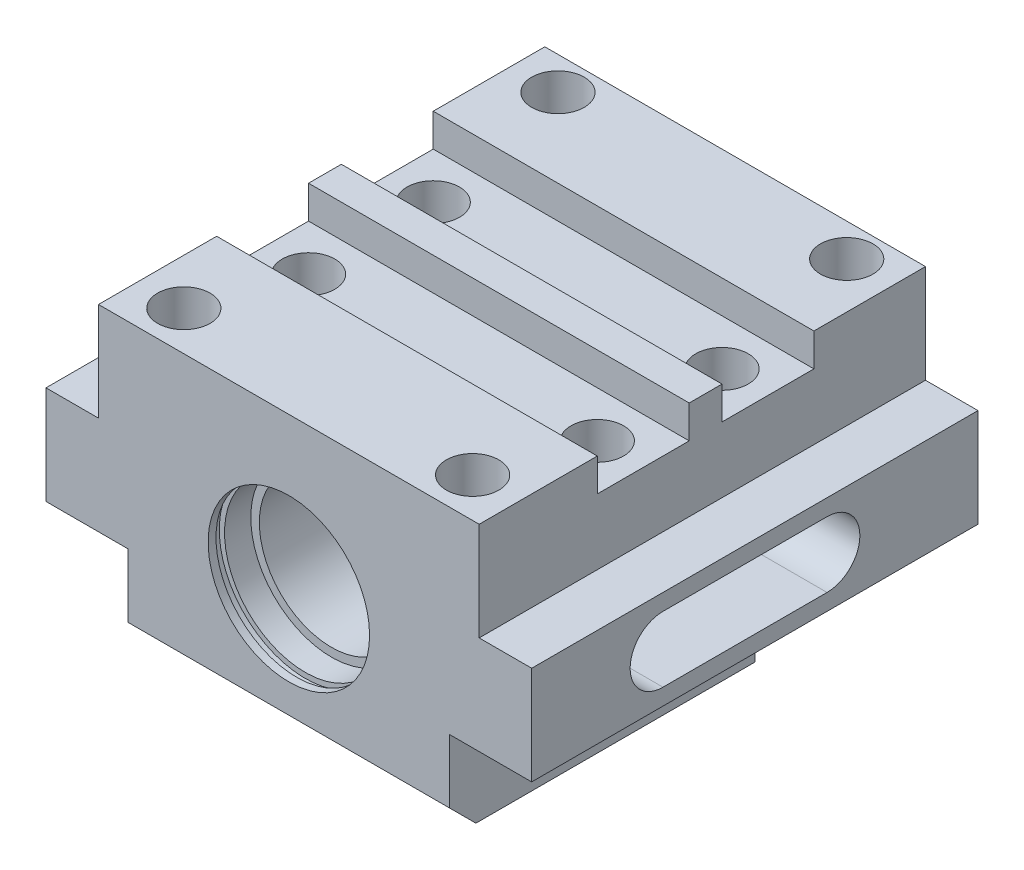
ISO-10303-21;
HEADER;
FILE_DESCRIPTION(('STEP AP214'),'2;1');
FILE_NAME('part.step','',(''),(''),'','','');
FILE_SCHEMA(('AUTOMOTIVE_DESIGN { 1 0 10303 214 1 1 1 1 }'));
ENDSEC;
DATA;
#1=APPLICATION_CONTEXT('core data for automotive mechanical design processes');
#2=APPLICATION_PROTOCOL_DEFINITION('international standard','automotive_design',2000,#1);
#3=PRODUCT_CONTEXT('',#1,'mechanical');
#4=PRODUCT('Part','Part','',(#3));
#5=PRODUCT_RELATED_PRODUCT_CATEGORY('part','',(#4));
#6=PRODUCT_DEFINITION_FORMATION('','',#4);
#7=PRODUCT_DEFINITION_CONTEXT('part definition',#1,'design');
#8=PRODUCT_DEFINITION('design','',#6,#7);
#9=PRODUCT_DEFINITION_SHAPE('','',#8);
#10=(LENGTH_UNIT() NAMED_UNIT(*) SI_UNIT(.MILLI.,.METRE.));
#11=(NAMED_UNIT(*) PLANE_ANGLE_UNIT() SI_UNIT($,.RADIAN.));
#12=(NAMED_UNIT(*) SI_UNIT($,.STERADIAN.) SOLID_ANGLE_UNIT());
#13=UNCERTAINTY_MEASURE_WITH_UNIT(LENGTH_MEASURE(1.E-05),#10,'distance_accuracy_value','');
#14=(GEOMETRIC_REPRESENTATION_CONTEXT(3) GLOBAL_UNCERTAINTY_ASSIGNED_CONTEXT((#13)) GLOBAL_UNIT_ASSIGNED_CONTEXT((#10,
#11,#12)) REPRESENTATION_CONTEXT('',''));
#15=CARTESIAN_POINT('',(0.,0.,0.));
#16=DIRECTION('',(0.,0.,1.));
#17=DIRECTION('',(1.,0.,0.));
#18=AXIS2_PLACEMENT_3D('',#15,#16,#17);
#19=CARTESIAN_POINT('',(0.,-1.18828558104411E-13,0.));
#20=DIRECTION('',(0.,-1.,0.));
#21=DIRECTION('',(0.,0.,-1.));
#22=AXIS2_PLACEMENT_3D('',#19,#20,#21);
#23=PLANE('',#22);
#24=CARTESIAN_POINT('',(-22.,1.35217391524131E-13,-29.));
#25=DIRECTION('',(0.,1.,0.));
#26=DIRECTION('',(0.,0.,1.));
#27=AXIS2_PLACEMENT_3D('',#24,#25,#26);
#28=CIRCLE('',#27,4.);
#29=CARTESIAN_POINT('',(-22.,1.16713674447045E-13,-25.));
#30=VERTEX_POINT('',#29);
#31=EDGE_CURVE('E1178',#30,#30,#28,.T.);
#32=ORIENTED_EDGE('',*,*,#31,.F.);
#33=EDGE_LOOP('',(#32));
#34=FACE_BOUND('',#33,.T.);
#35=DIRECTION('',(0.,0.,1.));
#36=VECTOR('',#35,1.);
#37=CARTESIAN_POINT('',(-29.,-1.28369537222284E-13,2.00000000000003));
#38=LINE('',#37,#36);
#39=CARTESIAN_POINT('',(-29.,0.,-34.));
#40=VERTEX_POINT('',#39);
#41=CARTESIAN_POINT('',(-29.,0.,-17.));
#42=VERTEX_POINT('',#41);
#43=EDGE_CURVE('E366',#40,#42,#38,.T.);
#44=ORIENTED_EDGE('',*,*,#43,.T.);
#45=DIRECTION('',(1.,0.,0.));
#46=VECTOR('',#45,1.);
#47=CARTESIAN_POINT('',(0.,0.,-17.));
#48=LINE('',#47,#46);
#49=CARTESIAN_POINT('',(29.,0.,-17.));
#50=VERTEX_POINT('',#49);
#51=EDGE_CURVE('E449',#42,#50,#48,.T.);
#52=ORIENTED_EDGE('',*,*,#51,.T.);
#53=DIRECTION('',(0.,0.,-1.));
#54=VECTOR('',#53,1.);
#55=CARTESIAN_POINT('',(29.,0.,-34.));
#56=LINE('',#55,#54);
#57=CARTESIAN_POINT('',(29.,0.,-34.));
#58=VERTEX_POINT('',#57);
#59=EDGE_CURVE('E371',#50,#58,#56,.T.);
#60=ORIENTED_EDGE('',*,*,#59,.T.);
#61=DIRECTION('',(-1.,0.,0.));
#62=VECTOR('',#61,1.);
#63=CARTESIAN_POINT('',(-29.,0.,-34.));
#64=LINE('',#63,#62);
#65=EDGE_CURVE('E362',#58,#40,#64,.T.);
#66=ORIENTED_EDGE('',*,*,#65,.T.);
#67=EDGE_LOOP('',(#44,#52,#60,#66));
#68=FACE_BOUND('',#67,.T.);
#69=CARTESIAN_POINT('',(22.,1.35217391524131E-13,-29.));
#70=DIRECTION('',(0.,1.,0.));
#71=DIRECTION('',(0.,0.,1.));
#72=AXIS2_PLACEMENT_3D('',#69,#70,#71);
#73=CIRCLE('',#72,4.);
#74=CARTESIAN_POINT('',(22.,1.16713674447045E-13,-25.));
#75=VERTEX_POINT('',#74);
#76=EDGE_CURVE('E1184',#75,#75,#73,.T.);
#77=ORIENTED_EDGE('',*,*,#76,.F.);
#78=EDGE_LOOP('',(#77));
#79=FACE_BOUND('',#78,.T.);
#80=ADVANCED_FACE('F17',(#34,#68,#79),#23,.F.);
#81=CARTESIAN_POINT('',(0.,-5.,0.));
#82=DIRECTION('',(0.,1.,0.));
#83=DIRECTION('',(0.,0.,1.));
#84=AXIS2_PLACEMENT_3D('',#81,#82,#83);
#85=PLANE('',#84);
#86=CARTESIAN_POINT('',(22.,-5.,9.));
#87=DIRECTION('',(0.,1.,0.));
#88=DIRECTION('',(0.,0.,1.));
#89=AXIS2_PLACEMENT_3D('',#86,#87,#88);
#90=CIRCLE('',#89,4.);
#91=CARTESIAN_POINT('',(22.,-5.00000000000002,13.));
#92=VERTEX_POINT('',#91);
#93=EDGE_CURVE('E1171',#92,#92,#90,.T.);
#94=ORIENTED_EDGE('',*,*,#93,.F.);
#95=EDGE_LOOP('',(#94));
#96=FACE_BOUND('',#95,.T.);
#97=CARTESIAN_POINT('',(-22.,-5.,9.));
#98=DIRECTION('',(0.,1.,0.));
#99=DIRECTION('',(0.,0.,1.));
#100=AXIS2_PLACEMENT_3D('',#97,#98,#99);
#101=CIRCLE('',#100,4.);
#102=CARTESIAN_POINT('',(-22.,-5.00000000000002,13.));
#103=VERTEX_POINT('',#102);
#104=EDGE_CURVE('E1156',#103,#103,#101,.T.);
#105=ORIENTED_EDGE('',*,*,#104,.F.);
#106=EDGE_LOOP('',(#105));
#107=FACE_BOUND('',#106,.T.);
#108=DIRECTION('',(0.,0.,1.));
#109=VECTOR('',#108,1.);
#110=CARTESIAN_POINT('',(29.,-5.0000000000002,34.));
#111=LINE('',#110,#109);
#112=CARTESIAN_POINT('',(29.,-5.00000000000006,2.));
#113=VERTEX_POINT('',#112);
#114=CARTESIAN_POINT('',(29.,-5.00000000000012,16.));
#115=VERTEX_POINT('',#114);
#116=EDGE_CURVE('E413',#113,#115,#111,.T.);
#117=ORIENTED_EDGE('',*,*,#116,.F.);
#118=DIRECTION('',(1.,0.,0.));
#119=VECTOR('',#118,1.);
#120=CARTESIAN_POINT('',(29.,-5.00000000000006,2.));
#121=LINE('',#120,#119);
#122=CARTESIAN_POINT('',(-29.,-5.00000000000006,2.));
#123=VERTEX_POINT('',#122);
#124=EDGE_CURVE('E356',#123,#113,#121,.T.);
#125=ORIENTED_EDGE('',*,*,#124,.F.);
#126=DIRECTION('',(0.,0.,-1.));
#127=VECTOR('',#126,1.);
#128=CARTESIAN_POINT('',(-29.,-4.99999999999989,-34.));
#129=LINE('',#128,#127);
#130=CARTESIAN_POINT('',(-29.,-5.,16.));
#131=VERTEX_POINT('',#130);
#132=EDGE_CURVE('E415',#131,#123,#129,.T.);
#133=ORIENTED_EDGE('',*,*,#132,.F.);
#134=DIRECTION('',(-1.,0.,0.));
#135=VECTOR('',#134,1.);
#136=CARTESIAN_POINT('',(29.,-5.,16.));
#137=LINE('',#136,#135);
#138=EDGE_CURVE('E424',#115,#131,#137,.T.);
#139=ORIENTED_EDGE('',*,*,#138,.F.);
#140=EDGE_LOOP('',(#117,#125,#133,#139));
#141=FACE_BOUND('',#140,.T.);
#142=ADVANCED_FACE('F497',(#96,#107,#141),#85,.T.);
#143=CARTESIAN_POINT('',(29.,-5.,16.));
#144=DIRECTION('',(0.,0.,-1.));
#145=DIRECTION('',(-1.,0.,0.));
#146=AXIS2_PLACEMENT_3D('',#143,#144,#145);
#147=PLANE('',#146);
#148=DIRECTION('',(-1.,0.,0.));
#149=VECTOR('',#148,1.);
#150=CARTESIAN_POINT('',(29.,0.,16.));
#151=LINE('',#150,#149);
#152=CARTESIAN_POINT('',(29.,0.,16.));
#153=VERTEX_POINT('',#152);
#154=CARTESIAN_POINT('',(-29.,0.,16.));
#155=VERTEX_POINT('',#154);
#156=EDGE_CURVE('E423',#153,#155,#151,.T.);
#157=ORIENTED_EDGE('',*,*,#156,.F.);
#158=DIRECTION('',(0.,1.,0.));
#159=VECTOR('',#158,1.);
#160=CARTESIAN_POINT('',(29.,-5.,16.));
#161=LINE('',#160,#159);
#162=EDGE_CURVE('E438',#115,#153,#161,.T.);
#163=ORIENTED_EDGE('',*,*,#162,.F.);
#164=ORIENTED_EDGE('',*,*,#138,.T.);
#165=DIRECTION('',(0.,1.,0.));
#166=VECTOR('',#165,1.);
#167=CARTESIAN_POINT('',(-29.,-5.,16.));
#168=LINE('',#167,#166);
#169=EDGE_CURVE('E427',#131,#155,#168,.T.);
#170=ORIENTED_EDGE('',*,*,#169,.T.);
#171=EDGE_LOOP('',(#157,#163,#164,#170));
#172=FACE_BOUND('',#171,.T.);
#173=ADVANCED_FACE('F505',(#172),#147,.T.);
#174=CARTESIAN_POINT('',(29.,-5.,34.));
#175=DIRECTION('',(1.,0.,0.));
#176=DIRECTION('',(0.,0.,-1.));
#177=AXIS2_PLACEMENT_3D('',#174,#175,#176);
#178=PLANE('',#177);
#179=DIRECTION('',(0.,1.,0.));
#180=VECTOR('',#179,1.);
#181=CARTESIAN_POINT('',(29.,-5.00000000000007,-17.));
#182=LINE('',#181,#180);
#183=CARTESIAN_POINT('',(29.,-5.00000000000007,-17.));
#184=VERTEX_POINT('',#183);
#185=EDGE_CURVE('E307',#184,#50,#182,.T.);
#186=ORIENTED_EDGE('',*,*,#185,.F.);
#187=DIRECTION('',(0.,0.,-1.));
#188=VECTOR('',#187,1.);
#189=CARTESIAN_POINT('',(29.,-5.,-3.));
#190=LINE('',#189,#188);
#191=CARTESIAN_POINT('',(29.,-5.,-3.));
#192=VERTEX_POINT('',#191);
#193=EDGE_CURVE('E315',#192,#184,#190,.T.);
#194=ORIENTED_EDGE('',*,*,#193,.F.);
#195=DIRECTION('',(0.,-1.,0.));
#196=VECTOR('',#195,1.);
#197=CARTESIAN_POINT('',(29.,0.,-3.));
#198=LINE('',#197,#196);
#199=CARTESIAN_POINT('',(29.,0.,-3.));
#200=VERTEX_POINT('',#199);
#201=EDGE_CURVE('E312',#200,#192,#198,.T.);
#202=ORIENTED_EDGE('',*,*,#201,.F.);
#203=CARTESIAN_POINT('',(29.,-1.28369537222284E-13,2.00000000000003));
#204=VERTEX_POINT('',#203);
#205=EDGE_CURVE('E372',#204,#200,#56,.T.);
#206=ORIENTED_EDGE('',*,*,#205,.F.);
#207=DIRECTION('',(0.,-1.,0.));
#208=VECTOR('',#207,1.);
#209=CARTESIAN_POINT('',(29.,-1.28369537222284E-13,2.00000000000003));
#210=LINE('',#209,#208);
#211=EDGE_CURVE('E375',#204,#113,#210,.T.);
#212=ORIENTED_EDGE('',*,*,#211,.T.);
#213=ORIENTED_EDGE('',*,*,#116,.T.);
#214=ORIENTED_EDGE('',*,*,#162,.T.);
#215=DIRECTION('',(0.,0.,-1.));
#216=VECTOR('',#215,1.);
#217=CARTESIAN_POINT('',(29.,0.,34.));
#218=LINE('',#217,#216);
#219=CARTESIAN_POINT('',(29.,0.,34.));
#220=VERTEX_POINT('',#219);
#221=EDGE_CURVE('E428',#220,#153,#218,.T.);
#222=ORIENTED_EDGE('',*,*,#221,.F.);
#223=DIRECTION('',(0.,1.,0.));
#224=VECTOR('',#223,1.);
#225=CARTESIAN_POINT('',(29.,-5.,34.));
#226=LINE('',#225,#224);
#227=CARTESIAN_POINT('',(29.,-15.,34.));
#228=VERTEX_POINT('',#227);
#229=EDGE_CURVE('E441',#228,#220,#226,.T.);
#230=ORIENTED_EDGE('',*,*,#229,.F.);
#231=DIRECTION('',(0.,0.,1.));
#232=VECTOR('',#231,1.);
#233=CARTESIAN_POINT('',(29.,-15.,34.));
#234=LINE('',#233,#232);
#235=CARTESIAN_POINT('',(29.,-15.,-34.));
#236=VERTEX_POINT('',#235);
#237=EDGE_CURVE('E397',#236,#228,#234,.T.);
#238=ORIENTED_EDGE('',*,*,#237,.F.);
#239=DIRECTION('',(0.,1.,0.));
#240=VECTOR('',#239,1.);
#241=CARTESIAN_POINT('',(29.,-43.7,-34.));
#242=LINE('',#241,#240);
#243=EDGE_CURVE('E418',#236,#58,#242,.T.);
#244=ORIENTED_EDGE('',*,*,#243,.T.);
#245=ORIENTED_EDGE('',*,*,#59,.F.);
#246=EDGE_LOOP('',(#186,#194,#202,#206,#212,#213,#214,#222,#230,#238,#244,#245));
#247=FACE_BOUND('',#246,.T.);
#248=ADVANCED_FACE('F530',(#247),#178,.T.);
#249=CARTESIAN_POINT('',(-29.,-5.,34.));
#250=DIRECTION('',(0.,0.,1.));
#251=DIRECTION('',(1.,0.,0.));
#252=AXIS2_PLACEMENT_3D('',#249,#250,#251);
#253=PLANE('',#252);
#254=CARTESIAN_POINT('',(0.,-23.,34.));
#255=DIRECTION('',(0.,0.,1.));
#256=DIRECTION('',(1.,0.,0.));
#257=AXIS2_PLACEMENT_3D('',#254,#255,#256);
#258=CIRCLE('',#257,12.3);
#259=CARTESIAN_POINT('',(12.3,-23.,34.));
#260=VERTEX_POINT('',#259);
#261=EDGE_CURVE('E1231',#260,#260,#258,.T.);
#262=ORIENTED_EDGE('',*,*,#261,.F.);
#263=EDGE_LOOP('',(#262));
#264=FACE_BOUND('',#263,.T.);
#265=DIRECTION('',(0.,1.,0.));
#266=VECTOR('',#265,1.);
#267=CARTESIAN_POINT('',(-24.5,-43.7,34.));
#268=LINE('',#267,#266);
#269=CARTESIAN_POINT('',(-24.5,-39.7,34.));
#270=VERTEX_POINT('',#269);
#271=CARTESIAN_POINT('',(-24.5,-30.,34.));
#272=VERTEX_POINT('',#271);
#273=EDGE_CURVE('E341',#270,#272,#268,.T.);
#274=ORIENTED_EDGE('',*,*,#273,.F.);
#275=DIRECTION('',(1.,0.,0.));
#276=VECTOR('',#275,1.);
#277=CARTESIAN_POINT('',(24.5,-39.7,34.));
#278=LINE('',#277,#276);
#279=CARTESIAN_POINT('',(24.5,-39.7,34.));
#280=VERTEX_POINT('',#279);
#281=EDGE_CURVE('E27',#270,#280,#278,.T.);
#282=ORIENTED_EDGE('',*,*,#281,.T.);
#283=DIRECTION('',(0.,-1.,0.));
#284=VECTOR('',#283,1.);
#285=CARTESIAN_POINT('',(24.5,-30.,34.));
#286=LINE('',#285,#284);
#287=CARTESIAN_POINT('',(24.5,-30.,34.));
#288=VERTEX_POINT('',#287);
#289=EDGE_CURVE('E331',#288,#280,#286,.T.);
#290=ORIENTED_EDGE('',*,*,#289,.F.);
#291=DIRECTION('',(-1.,0.,0.));
#292=VECTOR('',#291,1.);
#293=CARTESIAN_POINT('',(37.,-30.,34.));
#294=LINE('',#293,#292);
#295=CARTESIAN_POINT('',(37.,-30.,34.));
#296=VERTEX_POINT('',#295);
#297=EDGE_CURVE('E326',#296,#288,#294,.T.);
#298=ORIENTED_EDGE('',*,*,#297,.F.);
#299=DIRECTION('',(0.,-1.,0.));
#300=VECTOR('',#299,1.);
#301=CARTESIAN_POINT('',(37.,-43.7,34.));
#302=LINE('',#301,#300);
#303=CARTESIAN_POINT('',(37.,-15.,34.));
#304=VERTEX_POINT('',#303);
#305=EDGE_CURVE('E398',#304,#296,#302,.T.);
#306=ORIENTED_EDGE('',*,*,#305,.F.);
#307=DIRECTION('',(-1.,0.,0.));
#308=VECTOR('',#307,1.);
#309=CARTESIAN_POINT('',(37.,-15.,34.));
#310=LINE('',#309,#308);
#311=EDGE_CURVE('E405',#304,#228,#310,.T.);
#312=ORIENTED_EDGE('',*,*,#311,.T.);
#313=ORIENTED_EDGE('',*,*,#229,.T.);
#314=DIRECTION('',(1.,0.,0.));
#315=VECTOR('',#314,1.);
#316=CARTESIAN_POINT('',(-29.,0.,34.));
#317=LINE('',#316,#315);
#318=CARTESIAN_POINT('',(-29.,0.,34.));
#319=VERTEX_POINT('',#318);
#320=EDGE_CURVE('E434',#319,#220,#317,.T.);
#321=ORIENTED_EDGE('',*,*,#320,.F.);
#322=DIRECTION('',(0.,1.,0.));
#323=VECTOR('',#322,1.);
#324=CARTESIAN_POINT('',(-29.,-5.,34.));
#325=LINE('',#324,#323);
#326=CARTESIAN_POINT('',(-29.,-15.,34.));
#327=VERTEX_POINT('',#326);
#328=EDGE_CURVE('E444',#327,#319,#325,.T.);
#329=ORIENTED_EDGE('',*,*,#328,.F.);
#330=DIRECTION('',(1.,0.,0.));
#331=VECTOR('',#330,1.);
#332=CARTESIAN_POINT('',(-37.,-15.,34.));
#333=LINE('',#332,#331);
#334=CARTESIAN_POINT('',(-37.,-15.,34.));
#335=VERTEX_POINT('',#334);
#336=EDGE_CURVE('E394',#335,#327,#333,.T.);
#337=ORIENTED_EDGE('',*,*,#336,.F.);
#338=DIRECTION('',(0.,1.,0.));
#339=VECTOR('',#338,1.);
#340=CARTESIAN_POINT('',(-37.,-15.,34.));
#341=LINE('',#340,#339);
#342=CARTESIAN_POINT('',(-37.,-30.,34.));
#343=VERTEX_POINT('',#342);
#344=EDGE_CURVE('E385',#343,#335,#341,.T.);
#345=ORIENTED_EDGE('',*,*,#344,.F.);
#346=DIRECTION('',(-1.,0.,0.));
#347=VECTOR('',#346,1.);
#348=CARTESIAN_POINT('',(-24.5,-30.,34.));
#349=LINE('',#348,#347);
#350=EDGE_CURVE('E348',#272,#343,#349,.T.);
#351=ORIENTED_EDGE('',*,*,#350,.F.);
#352=EDGE_LOOP('',(#274,#282,#290,#298,#306,#312,#313,#321,#329,#337,#345,#351));
#353=FACE_BOUND('',#352,.T.);
#354=ADVANCED_FACE('F555',(#264,#353),#253,.T.);
#355=CARTESIAN_POINT('',(-29.,-5.,16.));
#356=DIRECTION('',(-1.,0.,0.));
#357=DIRECTION('',(0.,0.,1.));
#358=AXIS2_PLACEMENT_3D('',#355,#356,#357);
#359=PLANE('',#358);
#360=DIRECTION('',(0.,-1.,0.));
#361=VECTOR('',#360,1.);
#362=CARTESIAN_POINT('',(-29.,-5.,-17.));
#363=LINE('',#362,#361);
#364=CARTESIAN_POINT('',(-29.,-5.00000000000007,-17.));
#365=VERTEX_POINT('',#364);
#366=EDGE_CURVE('E324',#42,#365,#363,.T.);
#367=ORIENTED_EDGE('',*,*,#366,.F.);
#368=ORIENTED_EDGE('',*,*,#43,.F.);
#369=DIRECTION('',(0.,1.,0.));
#370=VECTOR('',#369,1.);
#371=CARTESIAN_POINT('',(-29.,-43.7,-34.));
#372=LINE('',#371,#370);
#373=CARTESIAN_POINT('',(-29.,-15.,-34.));
#374=VERTEX_POINT('',#373);
#375=EDGE_CURVE('E421',#374,#40,#372,.T.);
#376=ORIENTED_EDGE('',*,*,#375,.F.);
#377=DIRECTION('',(0.,0.,-1.));
#378=VECTOR('',#377,1.);
#379=CARTESIAN_POINT('',(-29.,-15.,-34.));
#380=LINE('',#379,#378);
#381=EDGE_CURVE('E381',#327,#374,#380,.T.);
#382=ORIENTED_EDGE('',*,*,#381,.F.);
#383=ORIENTED_EDGE('',*,*,#328,.T.);
#384=DIRECTION('',(0.,0.,1.));
#385=VECTOR('',#384,1.);
#386=CARTESIAN_POINT('',(-29.,0.,16.));
#387=LINE('',#386,#385);
#388=EDGE_CURVE('E431',#155,#319,#387,.T.);
#389=ORIENTED_EDGE('',*,*,#388,.F.);
#390=ORIENTED_EDGE('',*,*,#169,.F.);
#391=ORIENTED_EDGE('',*,*,#132,.T.);
#392=DIRECTION('',(0.,-1.,0.));
#393=VECTOR('',#392,1.);
#394=CARTESIAN_POINT('',(-29.,-1.28369537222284E-13,2.00000000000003));
#395=LINE('',#394,#393);
#396=CARTESIAN_POINT('',(-29.,-1.28369537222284E-13,2.00000000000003));
#397=VERTEX_POINT('',#396);
#398=EDGE_CURVE('E379',#397,#123,#395,.T.);
#399=ORIENTED_EDGE('',*,*,#398,.F.);
#400=CARTESIAN_POINT('',(-29.,-1.05239890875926E-13,-3.));
#401=VERTEX_POINT('',#400);
#402=EDGE_CURVE('E365',#401,#397,#38,.T.);
#403=ORIENTED_EDGE('',*,*,#402,.F.);
#404=DIRECTION('',(0.,1.,0.));
#405=VECTOR('',#404,1.);
#406=CARTESIAN_POINT('',(-29.,-5.,-3.));
#407=LINE('',#406,#405);
#408=CARTESIAN_POINT('',(-29.,-5.,-3.));
#409=VERTEX_POINT('',#408);
#410=EDGE_CURVE('E321',#409,#401,#407,.T.);
#411=ORIENTED_EDGE('',*,*,#410,.F.);
#412=DIRECTION('',(0.,0.,1.));
#413=VECTOR('',#412,1.);
#414=CARTESIAN_POINT('',(-29.,-4.99999999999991,16.));
#415=LINE('',#414,#413);
#416=EDGE_CURVE('E452',#365,#409,#415,.T.);
#417=ORIENTED_EDGE('',*,*,#416,.F.);
#418=EDGE_LOOP('',(#367,#368,#376,#382,#383,#389,#390,#391,#399,#403,#411,#417));
#419=FACE_BOUND('',#418,.T.);
#420=ADVANCED_FACE('F540',(#419),#359,.T.);
#421=CARTESIAN_POINT('',(0.,0.,0.));
#422=DIRECTION('',(0.,1.,0.));
#423=DIRECTION('',(0.,0.,1.));
#424=AXIS2_PLACEMENT_3D('',#421,#422,#423);
#425=PLANE('',#424);
#426=CARTESIAN_POINT('',(22.,0.,28.));
#427=DIRECTION('',(0.,1.,0.));
#428=DIRECTION('',(0.,0.,1.));
#429=AXIS2_PLACEMENT_3D('',#426,#427,#428);
#430=CIRCLE('',#429,4.);
#431=CARTESIAN_POINT('',(22.,0.,32.));
#432=VERTEX_POINT('',#431);
#433=EDGE_CURVE('E1153',#432,#432,#430,.T.);
#434=ORIENTED_EDGE('',*,*,#433,.F.);
#435=EDGE_LOOP('',(#434));
#436=FACE_BOUND('',#435,.T.);
#437=CARTESIAN_POINT('',(-22.,0.,28.));
#438=DIRECTION('',(0.,1.,0.));
#439=DIRECTION('',(0.,0.,1.));
#440=AXIS2_PLACEMENT_3D('',#437,#438,#439);
#441=CIRCLE('',#440,4.);
#442=CARTESIAN_POINT('',(-22.,0.,32.));
#443=VERTEX_POINT('',#442);
#444=EDGE_CURVE('E1159',#443,#443,#441,.T.);
#445=ORIENTED_EDGE('',*,*,#444,.F.);
#446=EDGE_LOOP('',(#445));
#447=FACE_BOUND('',#446,.T.);
#448=ORIENTED_EDGE('',*,*,#320,.T.);
#449=ORIENTED_EDGE('',*,*,#221,.T.);
#450=ORIENTED_EDGE('',*,*,#156,.T.);
#451=ORIENTED_EDGE('',*,*,#388,.T.);
#452=EDGE_LOOP('',(#448,#449,#450,#451));
#453=FACE_BOUND('',#452,.T.);
#454=ADVANCED_FACE('F552',(#436,#447,#453),#425,.T.);
#455=CARTESIAN_POINT('',(29.,-43.7,-34.));
#456=DIRECTION('',(0.,0.,1.));
#457=DIRECTION('',(0.,-1.,0.));
#458=AXIS2_PLACEMENT_3D('',#455,#456,#457);
#459=PLANE('',#458);
#460=CARTESIAN_POINT('',(0.,-23.,-34.));
#461=DIRECTION('',(0.,0.,1.));
#462=DIRECTION('',(1.,0.,0.));
#463=AXIS2_PLACEMENT_3D('',#460,#461,#462);
#464=CIRCLE('',#463,12.3);
#465=CARTESIAN_POINT('',(12.3,-23.,-34.));
#466=VERTEX_POINT('',#465);
#467=EDGE_CURVE('E251',#466,#466,#464,.T.);
#468=ORIENTED_EDGE('',*,*,#467,.T.);
#469=EDGE_LOOP('',(#468));
#470=FACE_BOUND('',#469,.T.);
#471=DIRECTION('',(0.,-1.,0.));
#472=VECTOR('',#471,1.);
#473=CARTESIAN_POINT('',(24.5,-30.,-34.));
#474=LINE('',#473,#472);
#475=CARTESIAN_POINT('',(24.5,-30.,-34.));
#476=VERTEX_POINT('',#475);
#477=CARTESIAN_POINT('',(24.5,-42.,-34.));
#478=VERTEX_POINT('',#477);
#479=EDGE_CURVE('E330',#476,#478,#474,.T.);
#480=ORIENTED_EDGE('',*,*,#479,.T.);
#481=DIRECTION('',(-1.,0.,0.));
#482=VECTOR('',#481,1.);
#483=CARTESIAN_POINT('',(37.,-42.,-34.));
#484=LINE('',#483,#482);
#485=CARTESIAN_POINT('',(-24.5,-42.,-34.));
#486=VERTEX_POINT('',#485);
#487=EDGE_CURVE('E304',#478,#486,#484,.T.);
#488=ORIENTED_EDGE('',*,*,#487,.T.);
#489=DIRECTION('',(0.,1.,0.));
#490=VECTOR('',#489,1.);
#491=CARTESIAN_POINT('',(-24.5,-43.7,-34.));
#492=LINE('',#491,#490);
#493=CARTESIAN_POINT('',(-24.5,-30.,-34.));
#494=VERTEX_POINT('',#493);
#495=EDGE_CURVE('E345',#486,#494,#492,.T.);
#496=ORIENTED_EDGE('',*,*,#495,.T.);
#497=DIRECTION('',(-1.,0.,0.));
#498=VECTOR('',#497,1.);
#499=CARTESIAN_POINT('',(-24.5,-30.,-34.));
#500=LINE('',#499,#498);
#501=CARTESIAN_POINT('',(-37.,-30.,-34.));
#502=VERTEX_POINT('',#501);
#503=EDGE_CURVE('E347',#494,#502,#500,.T.);
#504=ORIENTED_EDGE('',*,*,#503,.T.);
#505=DIRECTION('',(0.,-1.,0.));
#506=VECTOR('',#505,1.);
#507=CARTESIAN_POINT('',(-37.,-43.7,-34.));
#508=LINE('',#507,#506);
#509=CARTESIAN_POINT('',(-37.,-15.,-34.));
#510=VERTEX_POINT('',#509);
#511=EDGE_CURVE('E382',#510,#502,#508,.T.);
#512=ORIENTED_EDGE('',*,*,#511,.F.);
#513=DIRECTION('',(1.,0.,0.));
#514=VECTOR('',#513,1.);
#515=CARTESIAN_POINT('',(-37.,-15.,-34.));
#516=LINE('',#515,#514);
#517=EDGE_CURVE('E389',#510,#374,#516,.T.);
#518=ORIENTED_EDGE('',*,*,#517,.T.);
#519=ORIENTED_EDGE('',*,*,#375,.T.);
#520=ORIENTED_EDGE('',*,*,#65,.F.);
#521=ORIENTED_EDGE('',*,*,#243,.F.);
#522=DIRECTION('',(-1.,0.,0.));
#523=VECTOR('',#522,1.);
#524=CARTESIAN_POINT('',(37.,-15.,-34.));
#525=LINE('',#524,#523);
#526=CARTESIAN_POINT('',(37.,-15.,-34.));
#527=VERTEX_POINT('',#526);
#528=EDGE_CURVE('E410',#527,#236,#525,.T.);
#529=ORIENTED_EDGE('',*,*,#528,.F.);
#530=DIRECTION('',(0.,1.,0.));
#531=VECTOR('',#530,1.);
#532=CARTESIAN_POINT('',(37.,-15.,-34.));
#533=LINE('',#532,#531);
#534=CARTESIAN_POINT('',(37.,-30.,-34.));
#535=VERTEX_POINT('',#534);
#536=EDGE_CURVE('E401',#535,#527,#533,.T.);
#537=ORIENTED_EDGE('',*,*,#536,.F.);
#538=DIRECTION('',(-1.,0.,0.));
#539=VECTOR('',#538,1.);
#540=CARTESIAN_POINT('',(37.,-30.,-34.));
#541=LINE('',#540,#539);
#542=EDGE_CURVE('E327',#535,#476,#541,.T.);
#543=ORIENTED_EDGE('',*,*,#542,.T.);
#544=EDGE_LOOP('',(#480,#488,#496,#504,#512,#518,#519,#520,#521,#529,#537,#543));
#545=FACE_BOUND('',#544,.T.);
#546=ADVANCED_FACE('F565',(#470,#545),#459,.F.);
#547=CARTESIAN_POINT('',(0.,-43.7,-2.0211059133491E-13));
#548=DIRECTION('',(0.,1.,0.));
#549=DIRECTION('',(0.,0.,1.));
#550=AXIS2_PLACEMENT_3D('',#547,#548,#549);
#551=PLANE('',#550);
#552=DIRECTION('',(0.,0.,1.));
#553=VECTOR('',#552,1.);
#554=CARTESIAN_POINT('',(24.5,-43.7,-34.));
#555=LINE('',#554,#553);
#556=CARTESIAN_POINT('',(24.5,-43.7,-12.5));
#557=VERTEX_POINT('',#556);
#558=CARTESIAN_POINT('',(24.5,-43.7,30.));
#559=VERTEX_POINT('',#558);
#560=EDGE_CURVE('E338',#557,#559,#555,.T.);
#561=ORIENTED_EDGE('',*,*,#560,.T.);
#562=DIRECTION('',(-1.,0.,0.));
#563=VECTOR('',#562,1.);
#564=CARTESIAN_POINT('',(-24.5,-43.7,30.));
#565=LINE('',#564,#563);
#566=CARTESIAN_POINT('',(-24.5,-43.7,30.));
#567=VERTEX_POINT('',#566);
#568=EDGE_CURVE('E460',#559,#567,#565,.T.);
#569=ORIENTED_EDGE('',*,*,#568,.T.);
#570=DIRECTION('',(0.,0.,1.));
#571=VECTOR('',#570,1.);
#572=CARTESIAN_POINT('',(-24.5,-43.7,-34.));
#573=LINE('',#572,#571);
#574=CARTESIAN_POINT('',(-24.5,-43.7,-12.5));
#575=VERTEX_POINT('',#574);
#576=EDGE_CURVE('E354',#575,#567,#573,.T.);
#577=ORIENTED_EDGE('',*,*,#576,.F.);
#578=DIRECTION('',(-1.,0.,0.));
#579=VECTOR('',#578,1.);
#580=CARTESIAN_POINT('',(37.,-43.7,-12.5));
#581=LINE('',#580,#579);
#582=EDGE_CURVE('E303',#557,#575,#581,.T.);
#583=ORIENTED_EDGE('',*,*,#582,.F.);
#584=EDGE_LOOP('',(#561,#569,#577,#583));
#585=FACE_BOUND('',#584,.T.);
#586=ADVANCED_FACE('F467',(#585),#551,.F.);
#587=CARTESIAN_POINT('',(37.,-15.,34.));
#588=DIRECTION('',(0.,-1.,0.));
#589=DIRECTION('',(0.,0.,-1.));
#590=AXIS2_PLACEMENT_3D('',#587,#588,#589);
#591=PLANE('',#590);
#592=ORIENTED_EDGE('',*,*,#237,.T.);
#593=ORIENTED_EDGE('',*,*,#311,.F.);
#594=DIRECTION('',(0.,0.,1.));
#595=VECTOR('',#594,1.);
#596=CARTESIAN_POINT('',(37.,-15.,34.));
#597=LINE('',#596,#595);
#598=EDGE_CURVE('E403',#527,#304,#597,.T.);
#599=ORIENTED_EDGE('',*,*,#598,.F.);
#600=ORIENTED_EDGE('',*,*,#528,.T.);
#601=EDGE_LOOP('',(#592,#593,#599,#600));
#602=FACE_BOUND('',#601,.T.);
#603=ADVANCED_FACE('F560',(#602),#591,.F.);
#604=CARTESIAN_POINT('',(37.,0.,0.));
#605=DIRECTION('',(-1.,0.,0.));
#606=DIRECTION('',(0.,0.,1.));
#607=AXIS2_PLACEMENT_3D('',#604,#605,#606);
#608=PLANE('',#607);
#609=DIRECTION('',(0.,0.,-1.));
#610=VECTOR('',#609,1.);
#611=CARTESIAN_POINT('',(37.,-27.5,14.));
#612=LINE('',#611,#610);
#613=CARTESIAN_POINT('',(37.,-27.5,14.));
#614=VERTEX_POINT('',#613);
#615=CARTESIAN_POINT('',(37.,-27.5,-11.));
#616=VERTEX_POINT('',#615);
#617=EDGE_CURVE('E257',#614,#616,#612,.T.);
#618=ORIENTED_EDGE('',*,*,#617,.F.);
#619=CARTESIAN_POINT('',(37.,-22.5,14.));
#620=DIRECTION('',(1.,0.,0.));
#621=DIRECTION('',(0.,0.,-1.));
#622=AXIS2_PLACEMENT_3D('',#619,#620,#621);
#623=CIRCLE('',#622,5.);
#624=CARTESIAN_POINT('',(37.,-17.5,14.));
#625=VERTEX_POINT('',#624);
#626=EDGE_CURVE('E228',#625,#614,#623,.T.);
#627=ORIENTED_EDGE('',*,*,#626,.F.);
#628=DIRECTION('',(0.,0.,1.));
#629=VECTOR('',#628,1.);
#630=CARTESIAN_POINT('',(37.,-17.5,-11.));
#631=LINE('',#630,#629);
#632=CARTESIAN_POINT('',(37.,-17.5,-11.));
#633=VERTEX_POINT('',#632);
#634=EDGE_CURVE('E245',#633,#625,#631,.T.);
#635=ORIENTED_EDGE('',*,*,#634,.F.);
#636=CARTESIAN_POINT('',(37.,-22.5,-11.));
#637=DIRECTION('',(1.,0.,0.));
#638=DIRECTION('',(0.,0.,-1.));
#639=AXIS2_PLACEMENT_3D('',#636,#637,#638);
#640=CIRCLE('',#639,5.);
#641=EDGE_CURVE('E248',#616,#633,#640,.T.);
#642=ORIENTED_EDGE('',*,*,#641,.F.);
#643=EDGE_LOOP('',(#618,#627,#635,#642));
#644=FACE_BOUND('',#643,.T.);
#645=ORIENTED_EDGE('',*,*,#305,.T.);
#646=DIRECTION('',(0.,0.,1.));
#647=VECTOR('',#646,1.);
#648=CARTESIAN_POINT('',(37.,-30.,-34.));
#649=LINE('',#648,#647);
#650=EDGE_CURVE('E334',#535,#296,#649,.T.);
#651=ORIENTED_EDGE('',*,*,#650,.F.);
#652=ORIENTED_EDGE('',*,*,#536,.T.);
#653=ORIENTED_EDGE('',*,*,#598,.T.);
#654=EDGE_LOOP('',(#645,#651,#652,#653));
#655=FACE_BOUND('',#654,.T.);
#656=ADVANCED_FACE('F593',(#644,#655),#608,.F.);
#657=CARTESIAN_POINT('',(-37.,-15.,-34.));
#658=DIRECTION('',(0.,-1.,0.));
#659=DIRECTION('',(0.,0.,-1.));
#660=AXIS2_PLACEMENT_3D('',#657,#658,#659);
#661=PLANE('',#660);
#662=ORIENTED_EDGE('',*,*,#381,.T.);
#663=ORIENTED_EDGE('',*,*,#517,.F.);
#664=DIRECTION('',(0.,0.,-1.));
#665=VECTOR('',#664,1.);
#666=CARTESIAN_POINT('',(-37.,-15.,-34.));
#667=LINE('',#666,#665);
#668=EDGE_CURVE('E387',#335,#510,#667,.T.);
#669=ORIENTED_EDGE('',*,*,#668,.F.);
#670=ORIENTED_EDGE('',*,*,#336,.T.);
#671=EDGE_LOOP('',(#662,#663,#669,#670));
#672=FACE_BOUND('',#671,.T.);
#673=ADVANCED_FACE('F575',(#672),#661,.F.);
#674=CARTESIAN_POINT('',(-37.,0.,0.));
#675=DIRECTION('',(1.,0.,0.));
#676=DIRECTION('',(0.,0.,-1.));
#677=AXIS2_PLACEMENT_3D('',#674,#675,#676);
#678=PLANE('',#677);
#679=DIRECTION('',(0.,0.,1.));
#680=VECTOR('',#679,1.);
#681=CARTESIAN_POINT('',(-37.,-27.5,-11.));
#682=LINE('',#681,#680);
#683=CARTESIAN_POINT('',(-37.,-27.5,-11.));
#684=VERTEX_POINT('',#683);
#685=CARTESIAN_POINT('',(-37.,-27.5,14.));
#686=VERTEX_POINT('',#685);
#687=EDGE_CURVE('E282',#684,#686,#682,.T.);
#688=ORIENTED_EDGE('',*,*,#687,.F.);
#689=CARTESIAN_POINT('',(-37.,-22.5,-11.));
#690=DIRECTION('',(-1.,0.,0.));
#691=DIRECTION('',(0.,0.,1.));
#692=AXIS2_PLACEMENT_3D('',#689,#690,#691);
#693=CIRCLE('',#692,5.);
#694=CARTESIAN_POINT('',(-37.,-17.5,-11.));
#695=VERTEX_POINT('',#694);
#696=EDGE_CURVE('E263',#695,#684,#693,.T.);
#697=ORIENTED_EDGE('',*,*,#696,.F.);
#698=DIRECTION('',(0.,0.,-1.));
#699=VECTOR('',#698,1.);
#700=CARTESIAN_POINT('',(-37.,-17.5,14.));
#701=LINE('',#700,#699);
#702=CARTESIAN_POINT('',(-37.,-17.5,14.));
#703=VERTEX_POINT('',#702);
#704=EDGE_CURVE('E271',#703,#695,#701,.T.);
#705=ORIENTED_EDGE('',*,*,#704,.F.);
#706=CARTESIAN_POINT('',(-37.,-22.5,14.));
#707=DIRECTION('',(-1.,0.,0.));
#708=DIRECTION('',(0.,0.,1.));
#709=AXIS2_PLACEMENT_3D('',#706,#707,#708);
#710=CIRCLE('',#709,5.);
#711=EDGE_CURVE('E285',#686,#703,#710,.T.);
#712=ORIENTED_EDGE('',*,*,#711,.F.);
#713=EDGE_LOOP('',(#688,#697,#705,#712));
#714=FACE_BOUND('',#713,.T.);
#715=ORIENTED_EDGE('',*,*,#511,.T.);
#716=DIRECTION('',(0.,0.,1.));
#717=VECTOR('',#716,1.);
#718=CARTESIAN_POINT('',(-37.,-30.,-34.));
#719=LINE('',#718,#717);
#720=EDGE_CURVE('E357',#502,#343,#719,.T.);
#721=ORIENTED_EDGE('',*,*,#720,.T.);
#722=ORIENTED_EDGE('',*,*,#344,.T.);
#723=ORIENTED_EDGE('',*,*,#668,.T.);
#724=EDGE_LOOP('',(#715,#721,#722,#723));
#725=FACE_BOUND('',#724,.T.);
#726=ADVANCED_FACE('F521',(#714,#725),#678,.F.);
#727=CARTESIAN_POINT('',(29.,-1.28369537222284E-13,2.00000000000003));
#728=DIRECTION('',(0.,0.,-1.));
#729=DIRECTION('',(0.,1.,0.));
#730=AXIS2_PLACEMENT_3D('',#727,#728,#729);
#731=PLANE('',#730);
#732=ORIENTED_EDGE('',*,*,#124,.T.);
#733=ORIENTED_EDGE('',*,*,#211,.F.);
#734=DIRECTION('',(1.,0.,0.));
#735=VECTOR('',#734,1.);
#736=CARTESIAN_POINT('',(29.,-1.28369537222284E-13,2.00000000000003));
#737=LINE('',#736,#735);
#738=EDGE_CURVE('E369',#397,#204,#737,.T.);
#739=ORIENTED_EDGE('',*,*,#738,.F.);
#740=ORIENTED_EDGE('',*,*,#398,.T.);
#741=EDGE_LOOP('',(#732,#733,#739,#740));
#742=FACE_BOUND('',#741,.T.);
#743=ADVANCED_FACE('F513',(#742),#731,.F.);
#744=ORIENTED_EDGE('',*,*,#205,.T.);
#745=DIRECTION('',(-1.,0.,0.));
#746=VECTOR('',#745,1.);
#747=CARTESIAN_POINT('',(0.,-1.04950770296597E-13,-3.));
#748=LINE('',#747,#746);
#749=EDGE_CURVE('E440',#200,#401,#748,.T.);
#750=ORIENTED_EDGE('',*,*,#749,.T.);
#751=ORIENTED_EDGE('',*,*,#402,.T.);
#752=ORIENTED_EDGE('',*,*,#738,.T.);
#753=EDGE_LOOP('',(#744,#750,#751,#752));
#754=FACE_BOUND('',#753,.T.);
#755=ADVANCED_FACE('F500',(#754),#23,.F.);
#756=CARTESIAN_POINT('',(-24.5,-43.7,-34.));
#757=DIRECTION('',(1.,0.,0.));
#758=DIRECTION('',(0.,0.,-1.));
#759=AXIS2_PLACEMENT_3D('',#756,#757,#758);
#760=PLANE('',#759);
#761=ORIENTED_EDGE('',*,*,#576,.T.);
#762=DIRECTION('',(0.,0.707106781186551,0.707106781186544));
#763=VECTOR('',#762,1.);
#764=CARTESIAN_POINT('',(-24.5,-43.7,30.));
#765=LINE('',#764,#763);
#766=EDGE_CURVE('E41',#567,#270,#765,.T.);
#767=ORIENTED_EDGE('',*,*,#766,.T.);
#768=ORIENTED_EDGE('',*,*,#273,.T.);
#769=DIRECTION('',(0.,0.,1.));
#770=VECTOR('',#769,1.);
#771=CARTESIAN_POINT('',(-24.5,-30.,-34.));
#772=LINE('',#771,#770);
#773=EDGE_CURVE('E351',#494,#272,#772,.T.);
#774=ORIENTED_EDGE('',*,*,#773,.F.);
#775=ORIENTED_EDGE('',*,*,#495,.F.);
#776=DIRECTION('',(0.,0.,-1.));
#777=VECTOR('',#776,1.);
#778=CARTESIAN_POINT('',(-24.5,-42.,-12.5));
#779=LINE('',#778,#777);
#780=CARTESIAN_POINT('',(-24.5,-42.,-12.5));
#781=VERTEX_POINT('',#780);
#782=EDGE_CURVE('E301',#781,#486,#779,.T.);
#783=ORIENTED_EDGE('',*,*,#782,.F.);
#784=DIRECTION('',(0.,1.,0.));
#785=VECTOR('',#784,1.);
#786=CARTESIAN_POINT('',(-24.5,-43.7,-12.5));
#787=LINE('',#786,#785);
#788=EDGE_CURVE('E292',#575,#781,#787,.T.);
#789=ORIENTED_EDGE('',*,*,#788,.F.);
#790=EDGE_LOOP('',(#761,#767,#768,#774,#775,#783,#789));
#791=FACE_BOUND('',#790,.T.);
#792=ADVANCED_FACE('F473',(#791),#760,.F.);
#793=CARTESIAN_POINT('',(-24.5,-30.,-34.));
#794=DIRECTION('',(0.,1.,0.));
#795=DIRECTION('',(0.,0.,1.));
#796=AXIS2_PLACEMENT_3D('',#793,#794,#795);
#797=PLANE('',#796);
#798=ORIENTED_EDGE('',*,*,#350,.T.);
#799=ORIENTED_EDGE('',*,*,#720,.F.);
#800=ORIENTED_EDGE('',*,*,#503,.F.);
#801=ORIENTED_EDGE('',*,*,#773,.T.);
#802=EDGE_LOOP('',(#798,#799,#800,#801));
#803=FACE_BOUND('',#802,.T.);
#804=ADVANCED_FACE('F520',(#803),#797,.F.);
#805=CARTESIAN_POINT('',(24.5,-30.,-34.));
#806=DIRECTION('',(-1.,0.,0.));
#807=DIRECTION('',(0.,0.,1.));
#808=AXIS2_PLACEMENT_3D('',#805,#806,#807);
#809=PLANE('',#808);
#810=ORIENTED_EDGE('',*,*,#289,.T.);
#811=DIRECTION('',(0.,-0.707106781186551,-0.707106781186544));
#812=VECTOR('',#811,1.);
#813=CARTESIAN_POINT('',(24.5,-43.7,30.));
#814=LINE('',#813,#812);
#815=EDGE_CURVE('E11',#280,#559,#814,.T.);
#816=ORIENTED_EDGE('',*,*,#815,.T.);
#817=ORIENTED_EDGE('',*,*,#560,.F.);
#818=DIRECTION('',(0.,1.,0.));
#819=VECTOR('',#818,1.);
#820=CARTESIAN_POINT('',(24.5,-30.,-12.5));
#821=LINE('',#820,#819);
#822=CARTESIAN_POINT('',(24.5,-42.,-12.5));
#823=VERTEX_POINT('',#822);
#824=EDGE_CURVE('E454',#557,#823,#821,.T.);
#825=ORIENTED_EDGE('',*,*,#824,.T.);
#826=DIRECTION('',(0.,0.,-1.));
#827=VECTOR('',#826,1.);
#828=CARTESIAN_POINT('',(24.5,-42.,-34.));
#829=LINE('',#828,#827);
#830=EDGE_CURVE('E457',#823,#478,#829,.T.);
#831=ORIENTED_EDGE('',*,*,#830,.T.);
#832=ORIENTED_EDGE('',*,*,#479,.F.);
#833=DIRECTION('',(0.,0.,1.));
#834=VECTOR('',#833,1.);
#835=CARTESIAN_POINT('',(24.5,-30.,-34.));
#836=LINE('',#835,#834);
#837=EDGE_CURVE('E342',#476,#288,#836,.T.);
#838=ORIENTED_EDGE('',*,*,#837,.T.);
#839=EDGE_LOOP('',(#810,#816,#817,#825,#831,#832,#838));
#840=FACE_BOUND('',#839,.T.);
#841=ADVANCED_FACE('F480',(#840),#809,.F.);
#842=CARTESIAN_POINT('',(37.,-30.,-34.));
#843=DIRECTION('',(0.,1.,0.));
#844=DIRECTION('',(0.,0.,1.));
#845=AXIS2_PLACEMENT_3D('',#842,#843,#844);
#846=PLANE('',#845);
#847=ORIENTED_EDGE('',*,*,#297,.T.);
#848=ORIENTED_EDGE('',*,*,#837,.F.);
#849=ORIENTED_EDGE('',*,*,#542,.F.);
#850=ORIENTED_EDGE('',*,*,#650,.T.);
#851=EDGE_LOOP('',(#847,#848,#849,#850));
#852=FACE_BOUND('',#851,.T.);
#853=ADVANCED_FACE('F590',(#852),#846,.F.);
#854=CARTESIAN_POINT('',(-37.,-5.00000000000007,-17.));
#855=DIRECTION('',(0.,0.,-1.));
#856=DIRECTION('',(-1.,0.,0.));
#857=AXIS2_PLACEMENT_3D('',#854,#855,#856);
#858=PLANE('',#857);
#859=ORIENTED_EDGE('',*,*,#366,.T.);
#860=DIRECTION('',(1.,0.,0.));
#861=VECTOR('',#860,1.);
#862=CARTESIAN_POINT('',(-37.,-5.00000000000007,-17.));
#863=LINE('',#862,#861);
#864=EDGE_CURVE('E319',#365,#184,#863,.T.);
#865=ORIENTED_EDGE('',*,*,#864,.T.);
#866=ORIENTED_EDGE('',*,*,#185,.T.);
#867=ORIENTED_EDGE('',*,*,#51,.F.);
#868=EDGE_LOOP('',(#859,#865,#866,#867));
#869=FACE_BOUND('',#868,.T.);
#870=ADVANCED_FACE('F571',(#869),#858,.F.);
#871=CARTESIAN_POINT('',(-37.,-5.,-3.));
#872=DIRECTION('',(0.,-1.,0.));
#873=DIRECTION('',(0.,0.,-1.));
#874=AXIS2_PLACEMENT_3D('',#871,#872,#873);
#875=PLANE('',#874);
#876=CARTESIAN_POINT('',(-22.,-5.,-10.0000000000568));
#877=DIRECTION('',(0.,1.,0.));
#878=DIRECTION('',(0.,0.,1.));
#879=AXIS2_PLACEMENT_3D('',#876,#877,#878);
#880=CIRCLE('',#879,4.);
#881=CARTESIAN_POINT('',(-22.,-4.99999999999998,-6.00000000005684));
#882=VERTEX_POINT('',#881);
#883=EDGE_CURVE('E1190',#882,#882,#880,.T.);
#884=ORIENTED_EDGE('',*,*,#883,.F.);
#885=EDGE_LOOP('',(#884));
#886=FACE_BOUND('',#885,.T.);
#887=CARTESIAN_POINT('',(22.,-5.,-10.0000000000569));
#888=DIRECTION('',(0.,1.,0.));
#889=DIRECTION('',(0.,0.,1.));
#890=AXIS2_PLACEMENT_3D('',#887,#888,#889);
#891=CIRCLE('',#890,4.);
#892=CARTESIAN_POINT('',(22.,-4.99999999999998,-6.00000000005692));
#893=VERTEX_POINT('',#892);
#894=EDGE_CURVE('E1196',#893,#893,#891,.T.);
#895=ORIENTED_EDGE('',*,*,#894,.F.);
#896=EDGE_LOOP('',(#895));
#897=FACE_BOUND('',#896,.T.);
#898=ORIENTED_EDGE('',*,*,#416,.T.);
#899=DIRECTION('',(1.,0.,0.));
#900=VECTOR('',#899,1.);
#901=CARTESIAN_POINT('',(-37.,-5.,-3.));
#902=LINE('',#901,#900);
#903=EDGE_CURVE('E318',#409,#192,#902,.T.);
#904=ORIENTED_EDGE('',*,*,#903,.T.);
#905=ORIENTED_EDGE('',*,*,#193,.T.);
#906=ORIENTED_EDGE('',*,*,#864,.F.);
#907=EDGE_LOOP('',(#898,#904,#905,#906));
#908=FACE_BOUND('',#907,.T.);
#909=ADVANCED_FACE('F733',(#886,#897,#908),#875,.F.);
#910=CARTESIAN_POINT('',(-37.,0.,-3.));
#911=DIRECTION('',(0.,0.,1.));
#912=DIRECTION('',(1.,0.,0.));
#913=AXIS2_PLACEMENT_3D('',#910,#911,#912);
#914=PLANE('',#913);
#915=ORIENTED_EDGE('',*,*,#410,.T.);
#916=ORIENTED_EDGE('',*,*,#749,.F.);
#917=ORIENTED_EDGE('',*,*,#201,.T.);
#918=ORIENTED_EDGE('',*,*,#903,.F.);
#919=EDGE_LOOP('',(#915,#916,#917,#918));
#920=FACE_BOUND('',#919,.T.);
#921=ADVANCED_FACE('F535',(#920),#914,.F.);
#922=CARTESIAN_POINT('',(37.,-42.,-12.5));
#923=DIRECTION('',(0.,1.,0.));
#924=DIRECTION('',(0.,0.,1.));
#925=AXIS2_PLACEMENT_3D('',#922,#923,#924);
#926=PLANE('',#925);
#927=DIRECTION('',(-1.,0.,0.));
#928=VECTOR('',#927,1.);
#929=CARTESIAN_POINT('',(37.,-42.,-12.5));
#930=LINE('',#929,#928);
#931=EDGE_CURVE('E308',#823,#781,#930,.T.);
#932=ORIENTED_EDGE('',*,*,#931,.T.);
#933=ORIENTED_EDGE('',*,*,#782,.T.);
#934=ORIENTED_EDGE('',*,*,#487,.F.);
#935=ORIENTED_EDGE('',*,*,#830,.F.);
#936=EDGE_LOOP('',(#932,#933,#934,#935));
#937=FACE_BOUND('',#936,.T.);
#938=ADVANCED_FACE('F587',(#937),#926,.F.);
#939=CARTESIAN_POINT('',(37.,-43.7,-12.5));
#940=DIRECTION('',(0.,0.,1.));
#941=DIRECTION('',(1.,0.,0.));
#942=AXIS2_PLACEMENT_3D('',#939,#940,#941);
#943=PLANE('',#942);
#944=ORIENTED_EDGE('',*,*,#582,.T.);
#945=ORIENTED_EDGE('',*,*,#788,.T.);
#946=ORIENTED_EDGE('',*,*,#931,.F.);
#947=ORIENTED_EDGE('',*,*,#824,.F.);
#948=EDGE_LOOP('',(#944,#945,#946,#947));
#949=FACE_BOUND('',#948,.T.);
#950=ADVANCED_FACE('F477',(#949),#943,.F.);
#951=CARTESIAN_POINT('',(-27.,-22.5,-11.));
#952=DIRECTION('',(-1.,0.,0.));
#953=DIRECTION('',(0.,0.,1.));
#954=AXIS2_PLACEMENT_3D('',#951,#952,#953);
#955=CYLINDRICAL_SURFACE('',#954,5.);
#956=ORIENTED_EDGE('',*,*,#696,.T.);
#957=DIRECTION('',(-1.,0.,0.));
#958=VECTOR('',#957,1.);
#959=CARTESIAN_POINT('',(-27.,-27.5,-11.));
#960=LINE('',#959,#958);
#961=CARTESIAN_POINT('',(-27.,-27.5,-11.));
#962=VERTEX_POINT('',#961);
#963=EDGE_CURVE('E280',#962,#684,#960,.T.);
#964=ORIENTED_EDGE('',*,*,#963,.F.);
#965=CARTESIAN_POINT('',(-27.,-22.5,-11.));
#966=DIRECTION('',(-1.,0.,0.));
#967=DIRECTION('',(0.,0.,1.));
#968=AXIS2_PLACEMENT_3D('',#965,#966,#967);
#969=CIRCLE('',#968,5.);
#970=CARTESIAN_POINT('',(-27.,-17.5,-11.));
#971=VERTEX_POINT('',#970);
#972=EDGE_CURVE('E267',#971,#962,#969,.T.);
#973=ORIENTED_EDGE('',*,*,#972,.F.);
#974=DIRECTION('',(-1.,0.,0.));
#975=VECTOR('',#974,1.);
#976=CARTESIAN_POINT('',(-27.,-17.5,-11.));
#977=LINE('',#976,#975);
#978=EDGE_CURVE('E290',#971,#695,#977,.T.);
#979=ORIENTED_EDGE('',*,*,#978,.T.);
#980=EDGE_LOOP('',(#956,#964,#973,#979));
#981=FACE_BOUND('',#980,.T.);
#982=ADVANCED_FACE('F767',(#981),#955,.F.);
#983=CARTESIAN_POINT('',(-27.,-17.5,14.));
#984=DIRECTION('',(0.,1.,0.));
#985=DIRECTION('',(0.,0.,1.));
#986=AXIS2_PLACEMENT_3D('',#983,#984,#985);
#987=PLANE('',#986);
#988=ORIENTED_EDGE('',*,*,#704,.T.);
#989=ORIENTED_EDGE('',*,*,#978,.F.);
#990=DIRECTION('',(0.,0.,-1.));
#991=VECTOR('',#990,1.);
#992=CARTESIAN_POINT('',(-27.,-17.5,14.));
#993=LINE('',#992,#991);
#994=CARTESIAN_POINT('',(-27.,-17.5,14.));
#995=VERTEX_POINT('',#994);
#996=EDGE_CURVE('E277',#995,#971,#993,.T.);
#997=ORIENTED_EDGE('',*,*,#996,.F.);
#998=DIRECTION('',(-1.,0.,0.));
#999=VECTOR('',#998,1.);
#1000=CARTESIAN_POINT('',(-27.,-17.5,14.));
#1001=LINE('',#1000,#999);
#1002=EDGE_CURVE('E293',#995,#703,#1001,.T.);
#1003=ORIENTED_EDGE('',*,*,#1002,.T.);
#1004=EDGE_LOOP('',(#988,#989,#997,#1003));
#1005=FACE_BOUND('',#1004,.T.);
#1006=ADVANCED_FACE('F776',(#1005),#987,.F.);
#1007=CARTESIAN_POINT('',(-27.,-22.5,14.));
#1008=DIRECTION('',(-1.,0.,0.));
#1009=DIRECTION('',(0.,0.,1.));
#1010=AXIS2_PLACEMENT_3D('',#1007,#1008,#1009);
#1011=CYLINDRICAL_SURFACE('',#1010,5.);
#1012=ORIENTED_EDGE('',*,*,#711,.T.);
#1013=ORIENTED_EDGE('',*,*,#1002,.F.);
#1014=CARTESIAN_POINT('',(-27.,-22.5,14.));
#1015=DIRECTION('',(-1.,0.,0.));
#1016=DIRECTION('',(0.,0.,1.));
#1017=AXIS2_PLACEMENT_3D('',#1014,#1015,#1016);
#1018=CIRCLE('',#1017,5.);
#1019=CARTESIAN_POINT('',(-27.,-27.5,14.));
#1020=VERTEX_POINT('',#1019);
#1021=EDGE_CURVE('E274',#1020,#995,#1018,.T.);
#1022=ORIENTED_EDGE('',*,*,#1021,.F.);
#1023=DIRECTION('',(-1.,0.,0.));
#1024=VECTOR('',#1023,1.);
#1025=CARTESIAN_POINT('',(-27.,-27.5,14.));
#1026=LINE('',#1025,#1024);
#1027=EDGE_CURVE('E295',#1020,#686,#1026,.T.);
#1028=ORIENTED_EDGE('',*,*,#1027,.T.);
#1029=EDGE_LOOP('',(#1012,#1013,#1022,#1028));
#1030=FACE_BOUND('',#1029,.T.);
#1031=ADVANCED_FACE('F786',(#1030),#1011,.F.);
#1032=CARTESIAN_POINT('',(-27.,-27.5,-11.));
#1033=DIRECTION('',(0.,-1.,0.));
#1034=DIRECTION('',(0.,0.,-1.));
#1035=AXIS2_PLACEMENT_3D('',#1032,#1033,#1034);
#1036=PLANE('',#1035);
#1037=ORIENTED_EDGE('',*,*,#687,.T.);
#1038=ORIENTED_EDGE('',*,*,#1027,.F.);
#1039=DIRECTION('',(0.,0.,1.));
#1040=VECTOR('',#1039,1.);
#1041=CARTESIAN_POINT('',(-27.,-27.5,-11.));
#1042=LINE('',#1041,#1040);
#1043=EDGE_CURVE('E270',#962,#1020,#1042,.T.);
#1044=ORIENTED_EDGE('',*,*,#1043,.F.);
#1045=ORIENTED_EDGE('',*,*,#963,.T.);
#1046=EDGE_LOOP('',(#1037,#1038,#1044,#1045));
#1047=FACE_BOUND('',#1046,.T.);
#1048=ADVANCED_FACE('F796',(#1047),#1036,.F.);
#1049=CARTESIAN_POINT('',(-27.,-22.5,-11.));
#1050=DIRECTION('',(-1.,0.,0.));
#1051=DIRECTION('',(0.,0.,1.));
#1052=AXIS2_PLACEMENT_3D('',#1049,#1050,#1051);
#1053=PLANE('',#1052);
#1054=ORIENTED_EDGE('',*,*,#972,.T.);
#1055=ORIENTED_EDGE('',*,*,#1043,.T.);
#1056=ORIENTED_EDGE('',*,*,#1021,.T.);
#1057=ORIENTED_EDGE('',*,*,#996,.T.);
#1058=EDGE_LOOP('',(#1054,#1055,#1056,#1057));
#1059=FACE_BOUND('',#1058,.T.);
#1060=ADVANCED_FACE('F806',(#1059),#1053,.T.);
#1061=CARTESIAN_POINT('',(27.,-22.5,14.));
#1062=DIRECTION('',(1.,0.,0.));
#1063=DIRECTION('',(0.,0.,-1.));
#1064=AXIS2_PLACEMENT_3D('',#1061,#1062,#1063);
#1065=CYLINDRICAL_SURFACE('',#1064,5.);
#1066=ORIENTED_EDGE('',*,*,#626,.T.);
#1067=DIRECTION('',(1.,0.,0.));
#1068=VECTOR('',#1067,1.);
#1069=CARTESIAN_POINT('',(27.,-27.5,14.));
#1070=LINE('',#1069,#1068);
#1071=CARTESIAN_POINT('',(27.,-27.5,14.));
#1072=VERTEX_POINT('',#1071);
#1073=EDGE_CURVE('E221',#1072,#614,#1070,.T.);
#1074=ORIENTED_EDGE('',*,*,#1073,.F.);
#1075=CARTESIAN_POINT('',(27.,-22.5,14.));
#1076=DIRECTION('',(1.,0.,0.));
#1077=DIRECTION('',(0.,0.,-1.));
#1078=AXIS2_PLACEMENT_3D('',#1075,#1076,#1077);
#1079=CIRCLE('',#1078,5.);
#1080=CARTESIAN_POINT('',(27.,-17.5,14.));
#1081=VERTEX_POINT('',#1080);
#1082=EDGE_CURVE('E225',#1081,#1072,#1079,.T.);
#1083=ORIENTED_EDGE('',*,*,#1082,.F.);
#1084=DIRECTION('',(1.,0.,0.));
#1085=VECTOR('',#1084,1.);
#1086=CARTESIAN_POINT('',(27.,-17.5,14.));
#1087=LINE('',#1086,#1085);
#1088=EDGE_CURVE('E261',#1081,#625,#1087,.T.);
#1089=ORIENTED_EDGE('',*,*,#1088,.T.);
#1090=EDGE_LOOP('',(#1066,#1074,#1083,#1089));
#1091=FACE_BOUND('',#1090,.T.);
#1092=ADVANCED_FACE('F223',(#1091),#1065,.F.);
#1093=CARTESIAN_POINT('',(27.,-17.5,-11.));
#1094=DIRECTION('',(0.,1.,0.));
#1095=DIRECTION('',(0.,0.,1.));
#1096=AXIS2_PLACEMENT_3D('',#1093,#1094,#1095);
#1097=PLANE('',#1096);
#1098=ORIENTED_EDGE('',*,*,#634,.T.);
#1099=ORIENTED_EDGE('',*,*,#1088,.F.);
#1100=DIRECTION('',(0.,0.,1.));
#1101=VECTOR('',#1100,1.);
#1102=CARTESIAN_POINT('',(27.,-17.5,-11.));
#1103=LINE('',#1102,#1101);
#1104=CARTESIAN_POINT('',(27.,-17.5,-11.));
#1105=VERTEX_POINT('',#1104);
#1106=EDGE_CURVE('E233',#1105,#1081,#1103,.T.);
#1107=ORIENTED_EDGE('',*,*,#1106,.F.);
#1108=DIRECTION('',(1.,0.,0.));
#1109=VECTOR('',#1108,1.);
#1110=CARTESIAN_POINT('',(27.,-17.5,-11.));
#1111=LINE('',#1110,#1109);
#1112=EDGE_CURVE('E264',#1105,#633,#1111,.T.);
#1113=ORIENTED_EDGE('',*,*,#1112,.T.);
#1114=EDGE_LOOP('',(#1098,#1099,#1107,#1113));
#1115=FACE_BOUND('',#1114,.T.);
#1116=ADVANCED_FACE('F825',(#1115),#1097,.F.);
#1117=CARTESIAN_POINT('',(27.,-22.5,-11.));
#1118=DIRECTION('',(1.,0.,0.));
#1119=DIRECTION('',(0.,0.,-1.));
#1120=AXIS2_PLACEMENT_3D('',#1117,#1118,#1119);
#1121=CYLINDRICAL_SURFACE('',#1120,5.);
#1122=ORIENTED_EDGE('',*,*,#641,.T.);
#1123=ORIENTED_EDGE('',*,*,#1112,.F.);
#1124=CARTESIAN_POINT('',(27.,-22.5,-11.));
#1125=DIRECTION('',(1.,0.,0.));
#1126=DIRECTION('',(0.,0.,-1.));
#1127=AXIS2_PLACEMENT_3D('',#1124,#1125,#1126);
#1128=CIRCLE('',#1127,5.);
#1129=CARTESIAN_POINT('',(27.,-27.5,-11.));
#1130=VERTEX_POINT('',#1129);
#1131=EDGE_CURVE('E241',#1130,#1105,#1128,.T.);
#1132=ORIENTED_EDGE('',*,*,#1131,.F.);
#1133=DIRECTION('',(1.,0.,0.));
#1134=VECTOR('',#1133,1.);
#1135=CARTESIAN_POINT('',(27.,-27.5,-11.));
#1136=LINE('',#1135,#1134);
#1137=EDGE_CURVE('E232',#1130,#616,#1136,.T.);
#1138=ORIENTED_EDGE('',*,*,#1137,.T.);
#1139=EDGE_LOOP('',(#1122,#1123,#1132,#1138));
#1140=FACE_BOUND('',#1139,.T.);
#1141=ADVANCED_FACE('F834',(#1140),#1121,.F.);
#1142=CARTESIAN_POINT('',(27.,-27.5,14.));
#1143=DIRECTION('',(0.,-1.,0.));
#1144=DIRECTION('',(0.,0.,-1.));
#1145=AXIS2_PLACEMENT_3D('',#1142,#1143,#1144);
#1146=PLANE('',#1145);
#1147=ORIENTED_EDGE('',*,*,#617,.T.);
#1148=ORIENTED_EDGE('',*,*,#1137,.F.);
#1149=DIRECTION('',(0.,0.,-1.));
#1150=VECTOR('',#1149,1.);
#1151=CARTESIAN_POINT('',(27.,-27.5,14.));
#1152=LINE('',#1151,#1150);
#1153=EDGE_CURVE('E236',#1072,#1130,#1152,.T.);
#1154=ORIENTED_EDGE('',*,*,#1153,.F.);
#1155=ORIENTED_EDGE('',*,*,#1073,.T.);
#1156=EDGE_LOOP('',(#1147,#1148,#1154,#1155));
#1157=FACE_BOUND('',#1156,.T.);
#1158=ADVANCED_FACE('F237',(#1157),#1146,.F.);
#1159=CARTESIAN_POINT('',(27.,-22.5,14.));
#1160=DIRECTION('',(1.,0.,0.));
#1161=DIRECTION('',(0.,0.,-1.));
#1162=AXIS2_PLACEMENT_3D('',#1159,#1160,#1161);
#1163=PLANE('',#1162);
#1164=ORIENTED_EDGE('',*,*,#1082,.T.);
#1165=ORIENTED_EDGE('',*,*,#1153,.T.);
#1166=ORIENTED_EDGE('',*,*,#1131,.T.);
#1167=ORIENTED_EDGE('',*,*,#1106,.T.);
#1168=EDGE_LOOP('',(#1164,#1165,#1166,#1167));
#1169=FACE_BOUND('',#1168,.T.);
#1170=ADVANCED_FACE('F243',(#1169),#1163,.T.);
#1171=CARTESIAN_POINT('',(0.,-23.,-34.));
#1172=DIRECTION('',(0.,0.,1.));
#1173=DIRECTION('',(1.,0.,0.));
#1174=AXIS2_PLACEMENT_3D('',#1171,#1172,#1173);
#1175=CYLINDRICAL_SURFACE('',#1174,12.3);
#1176=ORIENTED_EDGE('',*,*,#467,.F.);
#1177=EDGE_LOOP('',(#1176));
#1178=FACE_BOUND('',#1177,.T.);
#1179=CARTESIAN_POINT('',(0.,-23.,-32.8));
#1180=DIRECTION('',(0.,0.,1.));
#1181=DIRECTION('',(1.,0.,0.));
#1182=AXIS2_PLACEMENT_3D('',#1179,#1180,#1181);
#1183=CIRCLE('',#1182,12.3);
#1184=CARTESIAN_POINT('',(12.3,-23.,-32.8));
#1185=VERTEX_POINT('',#1184);
#1186=EDGE_CURVE('E1202',#1185,#1185,#1183,.T.);
#1187=ORIENTED_EDGE('',*,*,#1186,.T.);
#1188=EDGE_LOOP('',(#1187));
#1189=FACE_BOUND('',#1188,.T.);
#1190=ADVANCED_FACE('F861',(#1178,#1189),#1175,.F.);
#1191=CARTESIAN_POINT('',(0.,-23.,-34.));
#1192=DIRECTION('',(0.,0.,1.));
#1193=DIRECTION('',(1.,0.,0.));
#1194=AXIS2_PLACEMENT_3D('',#1191,#1192,#1193);
#1195=CYLINDRICAL_SURFACE('',#1194,12.3);
#1196=CARTESIAN_POINT('',(0.,-23.,32.8));
#1197=DIRECTION('',(0.,0.,1.));
#1198=DIRECTION('',(1.,0.,0.));
#1199=AXIS2_PLACEMENT_3D('',#1196,#1197,#1198);
#1200=CIRCLE('',#1199,12.3);
#1201=CARTESIAN_POINT('',(12.3,-23.,32.8));
#1202=VERTEX_POINT('',#1201);
#1203=EDGE_CURVE('E1229',#1202,#1202,#1200,.T.);
#1204=ORIENTED_EDGE('',*,*,#1203,.F.);
#1205=EDGE_LOOP('',(#1204));
#1206=FACE_BOUND('',#1205,.T.);
#1207=ORIENTED_EDGE('',*,*,#261,.T.);
#1208=EDGE_LOOP('',(#1207));
#1209=FACE_BOUND('',#1208,.T.);
#1210=ADVANCED_FACE('F870',(#1206,#1209),#1195,.F.);
#1211=CARTESIAN_POINT('',(12.3,-23.,32.8));
#1212=DIRECTION('',(0.,0.,1.));
#1213=DIRECTION('',(1.,0.,0.));
#1214=AXIS2_PLACEMENT_3D('',#1211,#1212,#1213);
#1215=PLANE('',#1214);
#1216=CARTESIAN_POINT('',(0.,-23.,32.8));
#1217=DIRECTION('',(0.,0.,1.));
#1218=DIRECTION('',(1.,0.,0.));
#1219=AXIS2_PLACEMENT_3D('',#1216,#1217,#1218);
#1220=CIRCLE('',#1219,13.1);
#1221=CARTESIAN_POINT('',(13.1,-23.,32.8));
#1222=VERTEX_POINT('',#1221);
#1223=EDGE_CURVE('E1226',#1222,#1222,#1220,.T.);
#1224=ORIENTED_EDGE('',*,*,#1223,.F.);
#1225=EDGE_LOOP('',(#1224));
#1226=FACE_BOUND('',#1225,.T.);
#1227=ORIENTED_EDGE('',*,*,#1203,.T.);
#1228=EDGE_LOOP('',(#1227));
#1229=FACE_BOUND('',#1228,.T.);
#1230=ADVANCED_FACE('F880',(#1226,#1229),#1215,.F.);
#1231=CARTESIAN_POINT('',(0.,-23.,-34.));
#1232=DIRECTION('',(0.,0.,1.));
#1233=DIRECTION('',(1.,0.,0.));
#1234=AXIS2_PLACEMENT_3D('',#1231,#1232,#1233);
#1235=CYLINDRICAL_SURFACE('',#1234,13.1);
#1236=CARTESIAN_POINT('',(0.,-23.,31.5));
#1237=DIRECTION('',(0.,0.,1.));
#1238=DIRECTION('',(1.,0.,0.));
#1239=AXIS2_PLACEMENT_3D('',#1236,#1237,#1238);
#1240=CIRCLE('',#1239,13.1);
#1241=CARTESIAN_POINT('',(13.1,-23.,31.5));
#1242=VERTEX_POINT('',#1241);
#1243=EDGE_CURVE('E1223',#1242,#1242,#1240,.T.);
#1244=ORIENTED_EDGE('',*,*,#1243,.F.);
#1245=EDGE_LOOP('',(#1244));
#1246=FACE_BOUND('',#1245,.T.);
#1247=ORIENTED_EDGE('',*,*,#1223,.T.);
#1248=EDGE_LOOP('',(#1247));
#1249=FACE_BOUND('',#1248,.T.);
#1250=ADVANCED_FACE('F890',(#1246,#1249),#1235,.F.);
#1251=CARTESIAN_POINT('',(13.1,-23.,31.5));
#1252=DIRECTION('',(0.,0.,-1.));
#1253=DIRECTION('',(-1.,0.,0.));
#1254=AXIS2_PLACEMENT_3D('',#1251,#1252,#1253);
#1255=PLANE('',#1254);
#1256=CARTESIAN_POINT('',(0.,-23.,31.5));
#1257=DIRECTION('',(0.,0.,1.));
#1258=DIRECTION('',(1.,0.,0.));
#1259=AXIS2_PLACEMENT_3D('',#1256,#1257,#1258);
#1260=CIRCLE('',#1259,12.3);
#1261=CARTESIAN_POINT('',(12.3,-23.,31.5));
#1262=VERTEX_POINT('',#1261);
#1263=EDGE_CURVE('E1220',#1262,#1262,#1260,.T.);
#1264=ORIENTED_EDGE('',*,*,#1263,.F.);
#1265=EDGE_LOOP('',(#1264));
#1266=FACE_BOUND('',#1265,.T.);
#1267=ORIENTED_EDGE('',*,*,#1243,.T.);
#1268=EDGE_LOOP('',(#1267));
#1269=FACE_BOUND('',#1268,.T.);
#1270=ADVANCED_FACE('F900',(#1266,#1269),#1255,.F.);
#1271=CARTESIAN_POINT('',(0.,-23.,-34.));
#1272=DIRECTION('',(0.,0.,1.));
#1273=DIRECTION('',(1.,0.,0.));
#1274=AXIS2_PLACEMENT_3D('',#1271,#1272,#1273);
#1275=CYLINDRICAL_SURFACE('',#1274,12.3);
#1276=CARTESIAN_POINT('',(0.,-23.,27.5));
#1277=DIRECTION('',(0.,0.,1.));
#1278=DIRECTION('',(1.,0.,0.));
#1279=AXIS2_PLACEMENT_3D('',#1276,#1277,#1278);
#1280=CIRCLE('',#1279,12.3);
#1281=CARTESIAN_POINT('',(12.3,-23.,27.5));
#1282=VERTEX_POINT('',#1281);
#1283=EDGE_CURVE('E1217',#1282,#1282,#1280,.T.);
#1284=ORIENTED_EDGE('',*,*,#1283,.F.);
#1285=EDGE_LOOP('',(#1284));
#1286=FACE_BOUND('',#1285,.T.);
#1287=ORIENTED_EDGE('',*,*,#1263,.T.);
#1288=EDGE_LOOP('',(#1287));
#1289=FACE_BOUND('',#1288,.T.);
#1290=ADVANCED_FACE('F910',(#1286,#1289),#1275,.F.);
#1291=CARTESIAN_POINT('',(12.3,-23.,27.5));
#1292=DIRECTION('',(0.,0.,-1.));
#1293=DIRECTION('',(-1.,0.,0.));
#1294=AXIS2_PLACEMENT_3D('',#1291,#1292,#1293);
#1295=PLANE('',#1294);
#1296=CARTESIAN_POINT('',(0.,-23.,27.5));
#1297=DIRECTION('',(0.,0.,1.));
#1298=DIRECTION('',(1.,0.,0.));
#1299=AXIS2_PLACEMENT_3D('',#1296,#1297,#1298);
#1300=CIRCLE('',#1299,11.);
#1301=CARTESIAN_POINT('',(11.,-23.,27.5));
#1302=VERTEX_POINT('',#1301);
#1303=EDGE_CURVE('E1170',#1302,#1302,#1300,.T.);
#1304=ORIENTED_EDGE('',*,*,#1303,.F.);
#1305=EDGE_LOOP('',(#1304));
#1306=FACE_BOUND('',#1305,.T.);
#1307=ORIENTED_EDGE('',*,*,#1283,.T.);
#1308=EDGE_LOOP('',(#1307));
#1309=FACE_BOUND('',#1308,.T.);
#1310=ADVANCED_FACE('F920',(#1306,#1309),#1295,.F.);
#1311=CARTESIAN_POINT('',(10.,-23.,-27.5));
#1312=DIRECTION('',(0.,0.,1.));
#1313=DIRECTION('',(1.,0.,0.));
#1314=AXIS2_PLACEMENT_3D('',#1311,#1312,#1313);
#1315=PLANE('',#1314);
#1316=CARTESIAN_POINT('',(0.,-23.,-27.5));
#1317=DIRECTION('',(0.,0.,1.));
#1318=DIRECTION('',(1.,0.,0.));
#1319=AXIS2_PLACEMENT_3D('',#1316,#1317,#1318);
#1320=CIRCLE('',#1319,11.);
#1321=CARTESIAN_POINT('',(11.,-23.,-27.5));
#1322=VERTEX_POINT('',#1321);
#1323=EDGE_CURVE('E22',#1322,#1322,#1320,.T.);
#1324=ORIENTED_EDGE('',*,*,#1323,.T.);
#1325=EDGE_LOOP('',(#1324));
#1326=FACE_BOUND('',#1325,.T.);
#1327=CARTESIAN_POINT('',(0.,-23.,-27.5));
#1328=DIRECTION('',(0.,0.,1.));
#1329=DIRECTION('',(1.,0.,0.));
#1330=AXIS2_PLACEMENT_3D('',#1327,#1328,#1329);
#1331=CIRCLE('',#1330,12.3);
#1332=CARTESIAN_POINT('',(12.3,-23.,-27.5));
#1333=VERTEX_POINT('',#1332);
#1334=EDGE_CURVE('E1214',#1333,#1333,#1331,.T.);
#1335=ORIENTED_EDGE('',*,*,#1334,.F.);
#1336=EDGE_LOOP('',(#1335));
#1337=FACE_BOUND('',#1336,.T.);
#1338=ADVANCED_FACE('F930',(#1326,#1337),#1315,.F.);
#1339=CARTESIAN_POINT('',(0.,-23.,-34.));
#1340=DIRECTION('',(0.,0.,1.));
#1341=DIRECTION('',(1.,0.,0.));
#1342=AXIS2_PLACEMENT_3D('',#1339,#1340,#1341);
#1343=CYLINDRICAL_SURFACE('',#1342,12.3);
#1344=CARTESIAN_POINT('',(0.,-23.,-31.5));
#1345=DIRECTION('',(0.,0.,1.));
#1346=DIRECTION('',(1.,0.,0.));
#1347=AXIS2_PLACEMENT_3D('',#1344,#1345,#1346);
#1348=CIRCLE('',#1347,12.3);
#1349=CARTESIAN_POINT('',(12.3,-23.,-31.5));
#1350=VERTEX_POINT('',#1349);
#1351=EDGE_CURVE('E1211',#1350,#1350,#1348,.T.);
#1352=ORIENTED_EDGE('',*,*,#1351,.F.);
#1353=EDGE_LOOP('',(#1352));
#1354=FACE_BOUND('',#1353,.T.);
#1355=ORIENTED_EDGE('',*,*,#1334,.T.);
#1356=EDGE_LOOP('',(#1355));
#1357=FACE_BOUND('',#1356,.T.);
#1358=ADVANCED_FACE('F940',(#1354,#1357),#1343,.F.);
#1359=CARTESIAN_POINT('',(12.3,-23.,-31.5));
#1360=DIRECTION('',(0.,0.,1.));
#1361=DIRECTION('',(1.,0.,0.));
#1362=AXIS2_PLACEMENT_3D('',#1359,#1360,#1361);
#1363=PLANE('',#1362);
#1364=CARTESIAN_POINT('',(0.,-23.,-31.5));
#1365=DIRECTION('',(0.,0.,1.));
#1366=DIRECTION('',(1.,0.,0.));
#1367=AXIS2_PLACEMENT_3D('',#1364,#1365,#1366);
#1368=CIRCLE('',#1367,13.1);
#1369=CARTESIAN_POINT('',(13.1,-23.,-31.5));
#1370=VERTEX_POINT('',#1369);
#1371=EDGE_CURVE('E1208',#1370,#1370,#1368,.T.);
#1372=ORIENTED_EDGE('',*,*,#1371,.F.);
#1373=EDGE_LOOP('',(#1372));
#1374=FACE_BOUND('',#1373,.T.);
#1375=ORIENTED_EDGE('',*,*,#1351,.T.);
#1376=EDGE_LOOP('',(#1375));
#1377=FACE_BOUND('',#1376,.T.);
#1378=ADVANCED_FACE('F950',(#1374,#1377),#1363,.F.);
#1379=CARTESIAN_POINT('',(0.,-23.,-34.));
#1380=DIRECTION('',(0.,0.,1.));
#1381=DIRECTION('',(1.,0.,0.));
#1382=AXIS2_PLACEMENT_3D('',#1379,#1380,#1381);
#1383=CYLINDRICAL_SURFACE('',#1382,13.1);
#1384=CARTESIAN_POINT('',(0.,-23.,-32.8));
#1385=DIRECTION('',(0.,0.,1.));
#1386=DIRECTION('',(1.,0.,0.));
#1387=AXIS2_PLACEMENT_3D('',#1384,#1385,#1386);
#1388=CIRCLE('',#1387,13.1);
#1389=CARTESIAN_POINT('',(13.1,-23.,-32.8));
#1390=VERTEX_POINT('',#1389);
#1391=EDGE_CURVE('E1205',#1390,#1390,#1388,.T.);
#1392=ORIENTED_EDGE('',*,*,#1391,.F.);
#1393=EDGE_LOOP('',(#1392));
#1394=FACE_BOUND('',#1393,.T.);
#1395=ORIENTED_EDGE('',*,*,#1371,.T.);
#1396=EDGE_LOOP('',(#1395));
#1397=FACE_BOUND('',#1396,.T.);
#1398=ADVANCED_FACE('F960',(#1394,#1397),#1383,.F.);
#1399=CARTESIAN_POINT('',(13.1,-23.,-32.8));
#1400=DIRECTION('',(0.,0.,-1.));
#1401=DIRECTION('',(-1.,0.,0.));
#1402=AXIS2_PLACEMENT_3D('',#1399,#1400,#1401);
#1403=PLANE('',#1402);
#1404=ORIENTED_EDGE('',*,*,#1186,.F.);
#1405=EDGE_LOOP('',(#1404));
#1406=FACE_BOUND('',#1405,.T.);
#1407=ORIENTED_EDGE('',*,*,#1391,.T.);
#1408=EDGE_LOOP('',(#1407));
#1409=FACE_BOUND('',#1408,.T.);
#1410=ADVANCED_FACE('F970',(#1406,#1409),#1403,.F.);
#1411=CARTESIAN_POINT('',(22.,-21.,-10.0000000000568));
#1412=DIRECTION('',(0.,-1.,0.));
#1413=DIRECTION('',(0.,0.,-1.));
#1414=AXIS2_PLACEMENT_3D('',#1411,#1412,#1413);
#1415=PLANE('',#1414);
#1416=CARTESIAN_POINT('',(22.,-21.,-10.0000000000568));
#1417=DIRECTION('',(0.,1.,0.));
#1418=DIRECTION('',(0.,0.,1.));
#1419=AXIS2_PLACEMENT_3D('',#1416,#1417,#1418);
#1420=CIRCLE('',#1419,4.);
#1421=CARTESIAN_POINT('',(22.,-21.,-6.00000000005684));
#1422=VERTEX_POINT('',#1421);
#1423=EDGE_CURVE('E1199',#1422,#1422,#1420,.T.);
#1424=ORIENTED_EDGE('',*,*,#1423,.T.);
#1425=EDGE_LOOP('',(#1424));
#1426=FACE_BOUND('',#1425,.T.);
#1427=ADVANCED_FACE('F980',(#1426),#1415,.F.);
#1428=CARTESIAN_POINT('',(22.,-5.,-10.0000000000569));
#1429=DIRECTION('',(0.,1.,0.));
#1430=DIRECTION('',(0.,0.,1.));
#1431=AXIS2_PLACEMENT_3D('',#1428,#1429,#1430);
#1432=CYLINDRICAL_SURFACE('',#1431,4.);
#1433=ORIENTED_EDGE('',*,*,#1423,.F.);
#1434=EDGE_LOOP('',(#1433));
#1435=FACE_BOUND('',#1434,.T.);
#1436=ORIENTED_EDGE('',*,*,#894,.T.);
#1437=EDGE_LOOP('',(#1436));
#1438=FACE_BOUND('',#1437,.T.);
#1439=ADVANCED_FACE('F990',(#1435,#1438),#1432,.F.);
#1440=CARTESIAN_POINT('',(-22.,-21.,-10.0000000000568));
#1441=DIRECTION('',(0.,-1.,0.));
#1442=DIRECTION('',(0.,0.,-1.));
#1443=AXIS2_PLACEMENT_3D('',#1440,#1441,#1442);
#1444=PLANE('',#1443);
#1445=CARTESIAN_POINT('',(-22.,-21.,-10.0000000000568));
#1446=DIRECTION('',(0.,1.,0.));
#1447=DIRECTION('',(0.,0.,1.));
#1448=AXIS2_PLACEMENT_3D('',#1445,#1446,#1447);
#1449=CIRCLE('',#1448,4.);
#1450=CARTESIAN_POINT('',(-22.,-21.,-6.00000000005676));
#1451=VERTEX_POINT('',#1450);
#1452=EDGE_CURVE('E1193',#1451,#1451,#1449,.T.);
#1453=ORIENTED_EDGE('',*,*,#1452,.T.);
#1454=EDGE_LOOP('',(#1453));
#1455=FACE_BOUND('',#1454,.T.);
#1456=ADVANCED_FACE('F1000',(#1455),#1444,.F.);
#1457=CARTESIAN_POINT('',(-22.,-5.,-10.0000000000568));
#1458=DIRECTION('',(0.,1.,0.));
#1459=DIRECTION('',(0.,0.,1.));
#1460=AXIS2_PLACEMENT_3D('',#1457,#1458,#1459);
#1461=CYLINDRICAL_SURFACE('',#1460,4.);
#1462=ORIENTED_EDGE('',*,*,#1452,.F.);
#1463=EDGE_LOOP('',(#1462));
#1464=FACE_BOUND('',#1463,.T.);
#1465=ORIENTED_EDGE('',*,*,#883,.T.);
#1466=EDGE_LOOP('',(#1465));
#1467=FACE_BOUND('',#1466,.T.);
#1468=ADVANCED_FACE('F1010',(#1464,#1467),#1461,.F.);
#1469=CARTESIAN_POINT('',(22.,-16.,-29.));
#1470=DIRECTION('',(0.,-1.,0.));
#1471=DIRECTION('',(0.,0.,-1.));
#1472=AXIS2_PLACEMENT_3D('',#1469,#1470,#1471);
#1473=PLANE('',#1472);
#1474=CARTESIAN_POINT('',(22.,-16.,-29.));
#1475=DIRECTION('',(0.,1.,0.));
#1476=DIRECTION('',(0.,0.,1.));
#1477=AXIS2_PLACEMENT_3D('',#1474,#1475,#1476);
#1478=CIRCLE('',#1477,4.);
#1479=CARTESIAN_POINT('',(22.,-16.,-25.));
#1480=VERTEX_POINT('',#1479);
#1481=EDGE_CURVE('E1187',#1480,#1480,#1478,.T.);
#1482=ORIENTED_EDGE('',*,*,#1481,.T.);
#1483=EDGE_LOOP('',(#1482));
#1484=FACE_BOUND('',#1483,.T.);
#1485=ADVANCED_FACE('F1020',(#1484),#1473,.F.);
#1486=CARTESIAN_POINT('',(22.,1.34151948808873E-13,-29.));
#1487=DIRECTION('',(0.,1.,0.));
#1488=DIRECTION('',(0.,0.,1.));
#1489=AXIS2_PLACEMENT_3D('',#1486,#1487,#1488);
#1490=CYLINDRICAL_SURFACE('',#1489,4.);
#1491=ORIENTED_EDGE('',*,*,#1481,.F.);
#1492=EDGE_LOOP('',(#1491));
#1493=FACE_BOUND('',#1492,.T.);
#1494=ORIENTED_EDGE('',*,*,#76,.T.);
#1495=EDGE_LOOP('',(#1494));
#1496=FACE_BOUND('',#1495,.T.);
#1497=ADVANCED_FACE('F1030',(#1493,#1496),#1490,.F.);
#1498=CARTESIAN_POINT('',(-22.,-16.,-29.));
#1499=DIRECTION('',(0.,-1.,0.));
#1500=DIRECTION('',(0.,0.,-1.));
#1501=AXIS2_PLACEMENT_3D('',#1498,#1499,#1500);
#1502=PLANE('',#1501);
#1503=CARTESIAN_POINT('',(-22.,-16.,-29.));
#1504=DIRECTION('',(0.,1.,0.));
#1505=DIRECTION('',(0.,0.,1.));
#1506=AXIS2_PLACEMENT_3D('',#1503,#1504,#1505);
#1507=CIRCLE('',#1506,4.);
#1508=CARTESIAN_POINT('',(-22.,-16.,-25.));
#1509=VERTEX_POINT('',#1508);
#1510=EDGE_CURVE('E1181',#1509,#1509,#1507,.T.);
#1511=ORIENTED_EDGE('',*,*,#1510,.T.);
#1512=EDGE_LOOP('',(#1511));
#1513=FACE_BOUND('',#1512,.T.);
#1514=ADVANCED_FACE('F493',(#1513),#1502,.F.);
#1515=CARTESIAN_POINT('',(-22.,1.34151948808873E-13,-29.));
#1516=DIRECTION('',(0.,1.,0.));
#1517=DIRECTION('',(0.,0.,1.));
#1518=AXIS2_PLACEMENT_3D('',#1515,#1516,#1517);
#1519=CYLINDRICAL_SURFACE('',#1518,4.);
#1520=ORIENTED_EDGE('',*,*,#1510,.F.);
#1521=EDGE_LOOP('',(#1520));
#1522=FACE_BOUND('',#1521,.T.);
#1523=ORIENTED_EDGE('',*,*,#31,.T.);
#1524=EDGE_LOOP('',(#1523));
#1525=FACE_BOUND('',#1524,.T.);
#1526=ADVANCED_FACE('F483',(#1522,#1525),#1519,.F.);
#1527=CARTESIAN_POINT('',(0.,-43.7,30.));
#1528=DIRECTION('',(0.,-0.707106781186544,0.707106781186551));
#1529=DIRECTION('',(1.,0.,0.));
#1530=AXIS2_PLACEMENT_3D('',#1527,#1528,#1529);
#1531=PLANE('',#1530);
#1532=ORIENTED_EDGE('',*,*,#815,.F.);
#1533=ORIENTED_EDGE('',*,*,#281,.F.);
#1534=ORIENTED_EDGE('',*,*,#766,.F.);
#1535=ORIENTED_EDGE('',*,*,#568,.F.);
#1536=EDGE_LOOP('',(#1532,#1533,#1534,#1535));
#1537=FACE_BOUND('',#1536,.T.);
#1538=ADVANCED_FACE('F20',(#1537),#1531,.T.);
#1539=CARTESIAN_POINT('',(0.,-23.,-34.));
#1540=DIRECTION('',(0.,0.,1.));
#1541=DIRECTION('',(1.,0.,0.));
#1542=AXIS2_PLACEMENT_3D('',#1539,#1540,#1541);
#1543=CYLINDRICAL_SURFACE('',#1542,11.);
#1544=ORIENTED_EDGE('',*,*,#1303,.T.);
#1545=EDGE_LOOP('',(#1544));
#1546=FACE_BOUND('',#1545,.T.);
#1547=ORIENTED_EDGE('',*,*,#1323,.F.);
#1548=EDGE_LOOP('',(#1547));
#1549=FACE_BOUND('',#1548,.T.);
#1550=ADVANCED_FACE('F482',(#1546,#1549),#1543,.F.);
#1551=CARTESIAN_POINT('',(-22.,-21.,8.99999999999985));
#1552=DIRECTION('',(0.,1.,0.));
#1553=DIRECTION('',(0.,0.,1.));
#1554=AXIS2_PLACEMENT_3D('',#1551,#1552,#1553);
#1555=CYLINDRICAL_SURFACE('',#1554,4.);
#1556=CARTESIAN_POINT('',(-22.,-21.,8.99999999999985));
#1557=DIRECTION('',(0.,1.,0.));
#1558=DIRECTION('',(0.,0.,1.));
#1559=AXIS2_PLACEMENT_3D('',#1556,#1557,#1558);
#1560=CIRCLE('',#1559,4.);
#1561=CARTESIAN_POINT('',(-22.,-21.,12.9999999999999));
#1562=VERTEX_POINT('',#1561);
#1563=EDGE_CURVE('E1152',#1562,#1562,#1560,.T.);
#1564=ORIENTED_EDGE('',*,*,#1563,.F.);
#1565=EDGE_LOOP('',(#1564));
#1566=FACE_BOUND('',#1565,.T.);
#1567=ORIENTED_EDGE('',*,*,#104,.T.);
#1568=EDGE_LOOP('',(#1567));
#1569=FACE_BOUND('',#1568,.T.);
#1570=ADVANCED_FACE('F490',(#1566,#1569),#1555,.F.);
#1571=CARTESIAN_POINT('',(-22.,-21.,8.99999999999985));
#1572=DIRECTION('',(0.,1.,0.));
#1573=DIRECTION('',(0.,0.,1.));
#1574=AXIS2_PLACEMENT_3D('',#1571,#1572,#1573);
#1575=PLANE('',#1574);
#1576=ORIENTED_EDGE('',*,*,#1563,.T.);
#1577=EDGE_LOOP('',(#1576));
#1578=FACE_BOUND('',#1577,.T.);
#1579=ADVANCED_FACE('F1073',(#1578),#1575,.T.);
#1580=CARTESIAN_POINT('',(22.,-21.,8.99999999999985));
#1581=DIRECTION('',(0.,1.,0.));
#1582=DIRECTION('',(0.,0.,1.));
#1583=AXIS2_PLACEMENT_3D('',#1580,#1581,#1582);
#1584=CYLINDRICAL_SURFACE('',#1583,4.);
#1585=CARTESIAN_POINT('',(22.,-21.,8.99999999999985));
#1586=DIRECTION('',(0.,1.,0.));
#1587=DIRECTION('',(0.,0.,1.));
#1588=AXIS2_PLACEMENT_3D('',#1585,#1586,#1587);
#1589=CIRCLE('',#1588,4.);
#1590=CARTESIAN_POINT('',(22.,-21.,12.9999999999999));
#1591=VERTEX_POINT('',#1590);
#1592=EDGE_CURVE('E1167',#1591,#1591,#1589,.T.);
#1593=ORIENTED_EDGE('',*,*,#1592,.F.);
#1594=EDGE_LOOP('',(#1593));
#1595=FACE_BOUND('',#1594,.T.);
#1596=ORIENTED_EDGE('',*,*,#93,.T.);
#1597=EDGE_LOOP('',(#1596));
#1598=FACE_BOUND('',#1597,.T.);
#1599=ADVANCED_FACE('F1083',(#1595,#1598),#1584,.F.);
#1600=CARTESIAN_POINT('',(22.,-21.,8.99999999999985));
#1601=DIRECTION('',(0.,1.,0.));
#1602=DIRECTION('',(0.,0.,1.));
#1603=AXIS2_PLACEMENT_3D('',#1600,#1601,#1602);
#1604=PLANE('',#1603);
#1605=ORIENTED_EDGE('',*,*,#1592,.T.);
#1606=EDGE_LOOP('',(#1605));
#1607=FACE_BOUND('',#1606,.T.);
#1608=ADVANCED_FACE('F1093',(#1607),#1604,.T.);
#1609=CARTESIAN_POINT('',(-22.,-16.,28.));
#1610=DIRECTION('',(0.,1.,0.));
#1611=DIRECTION('',(0.,0.,1.));
#1612=AXIS2_PLACEMENT_3D('',#1609,#1610,#1611);
#1613=CYLINDRICAL_SURFACE('',#1612,4.);
#1614=CARTESIAN_POINT('',(-22.,-16.,28.));
#1615=DIRECTION('',(0.,1.,0.));
#1616=DIRECTION('',(0.,0.,1.));
#1617=AXIS2_PLACEMENT_3D('',#1614,#1615,#1616);
#1618=CIRCLE('',#1617,4.);
#1619=CARTESIAN_POINT('',(-22.,-16.,32.));
#1620=VERTEX_POINT('',#1619);
#1621=EDGE_CURVE('E1164',#1620,#1620,#1618,.T.);
#1622=ORIENTED_EDGE('',*,*,#1621,.F.);
#1623=EDGE_LOOP('',(#1622));
#1624=FACE_BOUND('',#1623,.T.);
#1625=ORIENTED_EDGE('',*,*,#444,.T.);
#1626=EDGE_LOOP('',(#1625));
#1627=FACE_BOUND('',#1626,.T.);
#1628=ADVANCED_FACE('F1103',(#1624,#1627),#1613,.F.);
#1629=CARTESIAN_POINT('',(-22.,-16.,28.));
#1630=DIRECTION('',(0.,1.,0.));
#1631=DIRECTION('',(0.,0.,1.));
#1632=AXIS2_PLACEMENT_3D('',#1629,#1630,#1631);
#1633=PLANE('',#1632);
#1634=ORIENTED_EDGE('',*,*,#1621,.T.);
#1635=EDGE_LOOP('',(#1634));
#1636=FACE_BOUND('',#1635,.T.);
#1637=ADVANCED_FACE('F1113',(#1636),#1633,.T.);
#1638=CARTESIAN_POINT('',(22.,-16.,28.));
#1639=DIRECTION('',(0.,1.,0.));
#1640=DIRECTION('',(0.,0.,1.));
#1641=AXIS2_PLACEMENT_3D('',#1638,#1639,#1640);
#1642=CYLINDRICAL_SURFACE('',#1641,4.);
#1643=CARTESIAN_POINT('',(22.,-16.,28.));
#1644=DIRECTION('',(0.,1.,0.));
#1645=DIRECTION('',(0.,0.,1.));
#1646=AXIS2_PLACEMENT_3D('',#1643,#1644,#1645);
#1647=CIRCLE('',#1646,4.);
#1648=CARTESIAN_POINT('',(22.,-16.,32.));
#1649=VERTEX_POINT('',#1648);
#1650=EDGE_CURVE('E1151',#1649,#1649,#1647,.T.);
#1651=ORIENTED_EDGE('',*,*,#1650,.F.);
#1652=EDGE_LOOP('',(#1651));
#1653=FACE_BOUND('',#1652,.T.);
#1654=ORIENTED_EDGE('',*,*,#433,.T.);
#1655=EDGE_LOOP('',(#1654));
#1656=FACE_BOUND('',#1655,.T.);
#1657=ADVANCED_FACE('F1123',(#1653,#1656),#1642,.F.);
#1658=CARTESIAN_POINT('',(22.,-16.,28.));
#1659=DIRECTION('',(0.,1.,0.));
#1660=DIRECTION('',(0.,0.,1.));
#1661=AXIS2_PLACEMENT_3D('',#1658,#1659,#1660);
#1662=PLANE('',#1661);
#1663=ORIENTED_EDGE('',*,*,#1650,.T.);
#1664=EDGE_LOOP('',(#1663));
#1665=FACE_BOUND('',#1664,.T.);
#1666=ADVANCED_FACE('F1133',(#1665),#1662,.T.);
#1667=CLOSED_SHELL('',(#80,#142,#173,#248,#354,#420,#454,#546,#586,#603,#656,#673,#726,#743,
#755,#792,#804,#841,#853,#870,#909,#921,#938,#950,#982,#1006,#1031,#1048,#1060,#1092,#1116,
#1141,#1158,#1170,#1190,#1210,#1230,#1250,#1270,#1290,#1310,#1338,#1358,#1378,#1398,#1410,#1427,
#1439,#1456,#1468,#1485,#1497,#1514,#1526,#1538,#1550,#1570,#1579,#1599,#1608,#1628,#1637,#1657,#1666));
#1668=MANIFOLD_SOLID_BREP('B1',#1667);
#1669=ADVANCED_BREP_SHAPE_REPRESENTATION('',(#18,#1668),#14);
#1670=SHAPE_DEFINITION_REPRESENTATION(#9,#1669);
ENDSEC;
END-ISO-10303-21;
